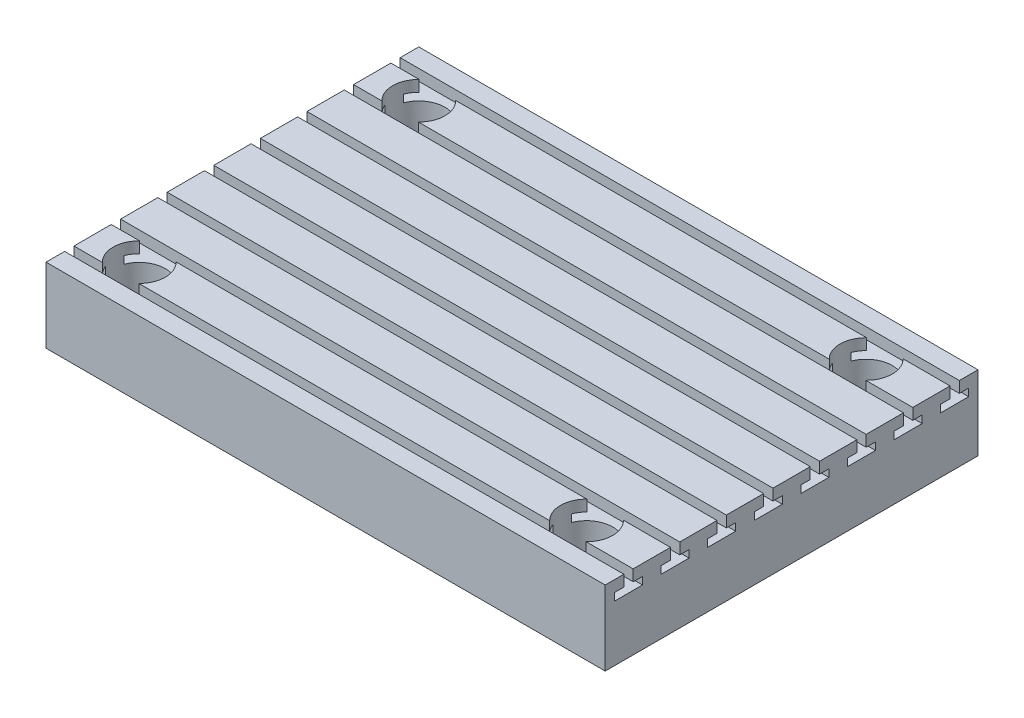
ISO-10303-21;
HEADER;
FILE_DESCRIPTION(('STEP AP214'),'2;1');
FILE_NAME('part.step','',(''),(''),'','','');
FILE_SCHEMA(('AUTOMOTIVE_DESIGN { 1 0 10303 214 1 1 1 1 }'));
ENDSEC;
DATA;
#1=APPLICATION_CONTEXT('core data for automotive mechanical design processes');
#2=APPLICATION_PROTOCOL_DEFINITION('international standard','automotive_design',2000,#1);
#3=PRODUCT_CONTEXT('',#1,'mechanical');
#4=PRODUCT('Part','Part','',(#3));
#5=PRODUCT_RELATED_PRODUCT_CATEGORY('part','',(#4));
#6=PRODUCT_DEFINITION_FORMATION('','',#4);
#7=PRODUCT_DEFINITION_CONTEXT('part definition',#1,'design');
#8=PRODUCT_DEFINITION('design','',#6,#7);
#9=PRODUCT_DEFINITION_SHAPE('','',#8);
#10=(LENGTH_UNIT() NAMED_UNIT(*) SI_UNIT(.MILLI.,.METRE.));
#11=(NAMED_UNIT(*) PLANE_ANGLE_UNIT() SI_UNIT($,.RADIAN.));
#12=(NAMED_UNIT(*) SI_UNIT($,.STERADIAN.) SOLID_ANGLE_UNIT());
#13=UNCERTAINTY_MEASURE_WITH_UNIT(LENGTH_MEASURE(1.E-05),#10,'distance_accuracy_value','');
#14=(GEOMETRIC_REPRESENTATION_CONTEXT(3) GLOBAL_UNCERTAINTY_ASSIGNED_CONTEXT((#13)) GLOBAL_UNIT_ASSIGNED_CONTEXT((#10,
#11,#12)) REPRESENTATION_CONTEXT('',''));
#15=CARTESIAN_POINT('',(0.,0.,0.));
#16=DIRECTION('',(0.,0.,1.));
#17=DIRECTION('',(1.,0.,0.));
#18=AXIS2_PLACEMENT_3D('',#15,#16,#17);
#19=CARTESIAN_POINT('',(-75.,20.,50.));
#20=DIRECTION('',(0.,1.,0.));
#21=DIRECTION('',(0.,0.,1.));
#22=AXIS2_PLACEMENT_3D('',#19,#20,#21);
#23=PLANE('',#22);
#24=DIRECTION('',(1.,0.,0.));
#25=VECTOR('',#24,1.);
#26=CARTESIAN_POINT('',(-75.,20.,-45.));
#27=LINE('',#26,#25);
#28=CARTESIAN_POINT('',(-75.,20.,-45.));
#29=VERTEX_POINT('',#28);
#30=CARTESIAN_POINT('',(75.,20.,-45.));
#31=VERTEX_POINT('',#30);
#32=EDGE_CURVE('E851',#29,#31,#27,.T.);
#33=ORIENTED_EDGE('',*,*,#32,.T.);
#34=DIRECTION('',(0.,0.,-1.));
#35=VECTOR('',#34,1.);
#36=CARTESIAN_POINT('',(75.,20.,-50.));
#37=LINE('',#36,#35);
#38=CARTESIAN_POINT('',(75.,20.,-50.));
#39=VERTEX_POINT('',#38);
#40=EDGE_CURVE('E689',#31,#39,#37,.T.);
#41=ORIENTED_EDGE('',*,*,#40,.T.);
#42=DIRECTION('',(-1.,0.,0.));
#43=VECTOR('',#42,1.);
#44=CARTESIAN_POINT('',(-75.,20.,-50.));
#45=LINE('',#44,#43);
#46=CARTESIAN_POINT('',(-75.,20.,-50.));
#47=VERTEX_POINT('',#46);
#48=EDGE_CURVE('E693',#39,#47,#45,.T.);
#49=ORIENTED_EDGE('',*,*,#48,.T.);
#50=DIRECTION('',(0.,0.,1.));
#51=VECTOR('',#50,1.);
#52=CARTESIAN_POINT('',(-75.,20.,-50.));
#53=LINE('',#52,#51);
#54=EDGE_CURVE('E677',#47,#29,#53,.T.);
#55=ORIENTED_EDGE('',*,*,#54,.T.);
#56=EDGE_LOOP('',(#33,#41,#49,#55));
#57=FACE_BOUND('',#56,.T.);
#58=ADVANCED_FACE('F31',(#57),#23,.T.);
#59=DIRECTION('',(1.,0.,0.));
#60=VECTOR('',#59,1.);
#61=CARTESIAN_POINT('',(-75.,20.,-42.5));
#62=LINE('',#61,#60);
#63=CARTESIAN_POINT('',(-75.,20.,-42.5));
#64=VERTEX_POINT('',#63);
#65=CARTESIAN_POINT('',(-67.3989794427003,20.,-42.5));
#66=VERTEX_POINT('',#65);
#67=EDGE_CURVE('E650',#64,#66,#62,.T.);
#68=ORIENTED_EDGE('',*,*,#67,.F.);
#69=CARTESIAN_POINT('',(-75.,20.,-32.5));
#70=VERTEX_POINT('',#69);
#71=EDGE_CURVE('E665',#64,#70,#53,.T.);
#72=ORIENTED_EDGE('',*,*,#71,.T.);
#73=DIRECTION('',(1.,0.,0.));
#74=VECTOR('',#73,1.);
#75=CARTESIAN_POINT('',(-75.,20.,-32.5));
#76=LINE('',#75,#74);
#77=CARTESIAN_POINT('',(-67.3989794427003,20.,-32.5));
#78=VERTEX_POINT('',#77);
#79=EDGE_CURVE('E1861',#70,#78,#76,.T.);
#80=ORIENTED_EDGE('',*,*,#79,.T.);
#81=CARTESIAN_POINT('',(-62.5,20.,-37.5));
#82=DIRECTION('',(0.,1.,0.));
#83=DIRECTION('',(0.,0.,1.));
#84=AXIS2_PLACEMENT_3D('',#81,#82,#83);
#85=CIRCLE('',#84,6.99999997);
#86=EDGE_CURVE('E667',#66,#78,#85,.T.);
#87=ORIENTED_EDGE('',*,*,#86,.F.);
#88=EDGE_LOOP('',(#68,#72,#80,#87));
#89=FACE_BOUND('',#88,.T.);
#90=ADVANCED_FACE('F663',(#89),#23,.T.);
#91=CARTESIAN_POINT('',(-57.6010205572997,20.,-42.5));
#92=VERTEX_POINT('',#91);
#93=CARTESIAN_POINT('',(52.6010205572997,20.,-42.5));
#94=VERTEX_POINT('',#93);
#95=EDGE_CURVE('E46',#92,#94,#62,.T.);
#96=ORIENTED_EDGE('',*,*,#95,.F.);
#97=CARTESIAN_POINT('',(-57.6010205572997,20.,-32.5));
#98=VERTEX_POINT('',#97);
#99=EDGE_CURVE('E720',#98,#92,#85,.T.);
#100=ORIENTED_EDGE('',*,*,#99,.F.);
#101=CARTESIAN_POINT('',(52.6010205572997,20.,-32.5));
#102=VERTEX_POINT('',#101);
#103=EDGE_CURVE('E1885',#98,#102,#76,.T.);
#104=ORIENTED_EDGE('',*,*,#103,.T.);
#105=CARTESIAN_POINT('',(57.5,20.,-37.5));
#106=DIRECTION('',(0.,1.,0.));
#107=DIRECTION('',(0.,0.,1.));
#108=AXIS2_PLACEMENT_3D('',#105,#106,#107);
#109=CIRCLE('',#108,6.99999997);
#110=EDGE_CURVE('E726',#94,#102,#109,.T.);
#111=ORIENTED_EDGE('',*,*,#110,.F.);
#112=EDGE_LOOP('',(#96,#100,#104,#111));
#113=FACE_BOUND('',#112,.T.);
#114=ADVANCED_FACE('F1382',(#113),#23,.T.);
#115=CARTESIAN_POINT('',(62.3989794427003,20.,-42.5));
#116=VERTEX_POINT('',#115);
#117=CARTESIAN_POINT('',(75.,20.,-42.5));
#118=VERTEX_POINT('',#117);
#119=EDGE_CURVE('E670',#116,#118,#62,.T.);
#120=ORIENTED_EDGE('',*,*,#119,.F.);
#121=CARTESIAN_POINT('',(62.3989794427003,20.,-32.5));
#122=VERTEX_POINT('',#121);
#123=EDGE_CURVE('E727',#122,#116,#109,.T.);
#124=ORIENTED_EDGE('',*,*,#123,.F.);
#125=CARTESIAN_POINT('',(75.,20.,-32.5));
#126=VERTEX_POINT('',#125);
#127=EDGE_CURVE('E1357',#122,#126,#76,.T.);
#128=ORIENTED_EDGE('',*,*,#127,.T.);
#129=EDGE_CURVE('E1346',#126,#118,#37,.T.);
#130=ORIENTED_EDGE('',*,*,#129,.T.);
#131=EDGE_LOOP('',(#120,#124,#128,#130));
#132=FACE_BOUND('',#131,.T.);
#133=ADVANCED_FACE('F1355',(#132),#23,.T.);
#134=DIRECTION('',(1.,0.,0.));
#135=VECTOR('',#134,1.);
#136=CARTESIAN_POINT('',(-75.,20.,-30.));
#137=LINE('',#136,#135);
#138=CARTESIAN_POINT('',(-75.,20.,-30.));
#139=VERTEX_POINT('',#138);
#140=CARTESIAN_POINT('',(75.,20.,-30.));
#141=VERTEX_POINT('',#140);
#142=EDGE_CURVE('E1862',#139,#141,#137,.T.);
#143=ORIENTED_EDGE('',*,*,#142,.F.);
#144=CARTESIAN_POINT('',(-75.,20.,-20.));
#145=VERTEX_POINT('',#144);
#146=EDGE_CURVE('E678',#139,#145,#53,.T.);
#147=ORIENTED_EDGE('',*,*,#146,.T.);
#148=DIRECTION('',(1.,0.,0.));
#149=VECTOR('',#148,1.);
#150=CARTESIAN_POINT('',(-75.,20.,-20.));
#151=LINE('',#150,#149);
#152=CARTESIAN_POINT('',(75.,20.,-20.));
#153=VERTEX_POINT('',#152);
#154=EDGE_CURVE('E983',#145,#153,#151,.T.);
#155=ORIENTED_EDGE('',*,*,#154,.T.);
#156=EDGE_CURVE('E1344',#153,#141,#37,.T.);
#157=ORIENTED_EDGE('',*,*,#156,.T.);
#158=EDGE_LOOP('',(#143,#147,#155,#157));
#159=FACE_BOUND('',#158,.T.);
#160=ADVANCED_FACE('F1606',(#159),#23,.T.);
#161=DIRECTION('',(1.,0.,0.));
#162=VECTOR('',#161,1.);
#163=CARTESIAN_POINT('',(-75.,20.,-17.5));
#164=LINE('',#163,#162);
#165=CARTESIAN_POINT('',(-75.,20.,-17.5));
#166=VERTEX_POINT('',#165);
#167=CARTESIAN_POINT('',(75.,20.,-17.5));
#168=VERTEX_POINT('',#167);
#169=EDGE_CURVE('E955',#166,#168,#164,.T.);
#170=ORIENTED_EDGE('',*,*,#169,.F.);
#171=CARTESIAN_POINT('',(-75.,20.,-7.50000000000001));
#172=VERTEX_POINT('',#171);
#173=EDGE_CURVE('E683',#166,#172,#53,.T.);
#174=ORIENTED_EDGE('',*,*,#173,.T.);
#175=DIRECTION('',(1.,0.,0.));
#176=VECTOR('',#175,1.);
#177=CARTESIAN_POINT('',(-75.,20.,-7.50000000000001));
#178=LINE('',#177,#176);
#179=CARTESIAN_POINT('',(75.,20.,-7.50000000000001));
#180=VERTEX_POINT('',#179);
#181=EDGE_CURVE('E953',#172,#180,#178,.T.);
#182=ORIENTED_EDGE('',*,*,#181,.T.);
#183=EDGE_CURVE('E1342',#180,#168,#37,.T.);
#184=ORIENTED_EDGE('',*,*,#183,.T.);
#185=EDGE_LOOP('',(#170,#174,#182,#184));
#186=FACE_BOUND('',#185,.T.);
#187=ADVANCED_FACE('F951',(#186),#23,.T.);
#188=DIRECTION('',(1.,0.,0.));
#189=VECTOR('',#188,1.);
#190=CARTESIAN_POINT('',(-75.,20.,-5.00000000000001));
#191=LINE('',#190,#189);
#192=CARTESIAN_POINT('',(-75.,20.,-5.00000000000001));
#193=VERTEX_POINT('',#192);
#194=CARTESIAN_POINT('',(75.,20.,-5.00000000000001));
#195=VERTEX_POINT('',#194);
#196=EDGE_CURVE('E971',#193,#195,#191,.T.);
#197=ORIENTED_EDGE('',*,*,#196,.F.);
#198=CARTESIAN_POINT('',(-75.,20.,4.99999999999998));
#199=VERTEX_POINT('',#198);
#200=EDGE_CURVE('E935',#193,#199,#53,.T.);
#201=ORIENTED_EDGE('',*,*,#200,.T.);
#202=DIRECTION('',(1.,0.,0.));
#203=VECTOR('',#202,1.);
#204=CARTESIAN_POINT('',(-75.,20.,4.99999999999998));
#205=LINE('',#204,#203);
#206=CARTESIAN_POINT('',(75.,20.,4.99999999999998));
#207=VERTEX_POINT('',#206);
#208=EDGE_CURVE('E1051',#199,#207,#205,.T.);
#209=ORIENTED_EDGE('',*,*,#208,.T.);
#210=EDGE_CURVE('E1339',#207,#195,#37,.T.);
#211=ORIENTED_EDGE('',*,*,#210,.T.);
#212=EDGE_LOOP('',(#197,#201,#209,#211));
#213=FACE_BOUND('',#212,.T.);
#214=ADVANCED_FACE('F1621',(#213),#23,.T.);
#215=DIRECTION('',(1.,0.,0.));
#216=VECTOR('',#215,1.);
#217=CARTESIAN_POINT('',(-75.,20.,7.49999999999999));
#218=LINE('',#217,#216);
#219=CARTESIAN_POINT('',(-75.,20.,7.49999999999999));
#220=VERTEX_POINT('',#219);
#221=CARTESIAN_POINT('',(75.,20.,7.49999999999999));
#222=VERTEX_POINT('',#221);
#223=EDGE_CURVE('E1032',#220,#222,#218,.T.);
#224=ORIENTED_EDGE('',*,*,#223,.F.);
#225=CARTESIAN_POINT('',(-75.,20.,17.5));
#226=VERTEX_POINT('',#225);
#227=EDGE_CURVE('E929',#220,#226,#53,.T.);
#228=ORIENTED_EDGE('',*,*,#227,.T.);
#229=DIRECTION('',(1.,0.,0.));
#230=VECTOR('',#229,1.);
#231=CARTESIAN_POINT('',(-75.,20.,17.5));
#232=LINE('',#231,#230);
#233=CARTESIAN_POINT('',(75.,20.,17.5));
#234=VERTEX_POINT('',#233);
#235=EDGE_CURVE('E1108',#226,#234,#232,.T.);
#236=ORIENTED_EDGE('',*,*,#235,.T.);
#237=EDGE_CURVE('E1336',#234,#222,#37,.T.);
#238=ORIENTED_EDGE('',*,*,#237,.T.);
#239=EDGE_LOOP('',(#224,#228,#236,#238));
#240=FACE_BOUND('',#239,.T.);
#241=ADVANCED_FACE('F1406',(#240),#23,.T.);
#242=DIRECTION('',(1.,0.,0.));
#243=VECTOR('',#242,1.);
#244=CARTESIAN_POINT('',(-75.,20.,20.));
#245=LINE('',#244,#243);
#246=CARTESIAN_POINT('',(-75.,20.,20.));
#247=VERTEX_POINT('',#246);
#248=CARTESIAN_POINT('',(75.,20.,20.));
#249=VERTEX_POINT('',#248);
#250=EDGE_CURVE('E1089',#247,#249,#245,.T.);
#251=ORIENTED_EDGE('',*,*,#250,.F.);
#252=CARTESIAN_POINT('',(-75.,20.,30.));
#253=VERTEX_POINT('',#252);
#254=EDGE_CURVE('E923',#247,#253,#53,.T.);
#255=ORIENTED_EDGE('',*,*,#254,.T.);
#256=DIRECTION('',(1.,0.,0.));
#257=VECTOR('',#256,1.);
#258=CARTESIAN_POINT('',(-75.,20.,30.));
#259=LINE('',#258,#257);
#260=CARTESIAN_POINT('',(75.,20.,30.));
#261=VERTEX_POINT('',#260);
#262=EDGE_CURVE('E1165',#253,#261,#259,.T.);
#263=ORIENTED_EDGE('',*,*,#262,.T.);
#264=EDGE_CURVE('E1334',#261,#249,#37,.T.);
#265=ORIENTED_EDGE('',*,*,#264,.T.);
#266=EDGE_LOOP('',(#251,#255,#263,#265));
#267=FACE_BOUND('',#266,.T.);
#268=ADVANCED_FACE('F1402',(#267),#23,.T.);
#269=DIRECTION('',(1.,0.,0.));
#270=VECTOR('',#269,1.);
#271=CARTESIAN_POINT('',(-75.,20.,32.5));
#272=LINE('',#271,#270);
#273=CARTESIAN_POINT('',(-75.,20.,32.5));
#274=VERTEX_POINT('',#273);
#275=CARTESIAN_POINT('',(-67.3989794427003,20.,32.5));
#276=VERTEX_POINT('',#275);
#277=EDGE_CURVE('E1189',#274,#276,#272,.T.);
#278=ORIENTED_EDGE('',*,*,#277,.F.);
#279=CARTESIAN_POINT('',(-75.,20.,42.5));
#280=VERTEX_POINT('',#279);
#281=EDGE_CURVE('E922',#274,#280,#53,.T.);
#282=ORIENTED_EDGE('',*,*,#281,.T.);
#283=DIRECTION('',(1.,0.,0.));
#284=VECTOR('',#283,1.);
#285=CARTESIAN_POINT('',(-75.,20.,42.5));
#286=LINE('',#285,#284);
#287=CARTESIAN_POINT('',(-67.3989794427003,20.,42.5));
#288=VERTEX_POINT('',#287);
#289=EDGE_CURVE('E1249',#280,#288,#286,.T.);
#290=ORIENTED_EDGE('',*,*,#289,.T.);
#291=CARTESIAN_POINT('',(-62.5,20.,37.5));
#292=DIRECTION('',(0.,1.,0.));
#293=DIRECTION('',(0.,0.,1.));
#294=AXIS2_PLACEMENT_3D('',#291,#292,#293);
#295=CIRCLE('',#294,6.99999997);
#296=EDGE_CURVE('E1302',#276,#288,#295,.T.);
#297=ORIENTED_EDGE('',*,*,#296,.F.);
#298=EDGE_LOOP('',(#278,#282,#290,#297));
#299=FACE_BOUND('',#298,.T.);
#300=ADVANCED_FACE('F1398',(#299),#23,.T.);
#301=CARTESIAN_POINT('',(-57.6010205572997,20.,32.5));
#302=VERTEX_POINT('',#301);
#303=CARTESIAN_POINT('',(52.6010205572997,20.,32.5));
#304=VERTEX_POINT('',#303);
#305=EDGE_CURVE('E1191',#302,#304,#272,.T.);
#306=ORIENTED_EDGE('',*,*,#305,.F.);
#307=CARTESIAN_POINT('',(-57.6010205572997,20.,42.5));
#308=VERTEX_POINT('',#307);
#309=EDGE_CURVE('E686',#308,#302,#295,.T.);
#310=ORIENTED_EDGE('',*,*,#309,.F.);
#311=CARTESIAN_POINT('',(52.6010205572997,20.,42.5));
#312=VERTEX_POINT('',#311);
#313=EDGE_CURVE('E1252',#308,#312,#286,.T.);
#314=ORIENTED_EDGE('',*,*,#313,.T.);
#315=CARTESIAN_POINT('',(57.5,20.,37.5));
#316=DIRECTION('',(0.,1.,0.));
#317=DIRECTION('',(0.,0.,1.));
#318=AXIS2_PLACEMENT_3D('',#315,#316,#317);
#319=CIRCLE('',#318,6.99999997);
#320=EDGE_CURVE('E1297',#304,#312,#319,.T.);
#321=ORIENTED_EDGE('',*,*,#320,.F.);
#322=EDGE_LOOP('',(#306,#310,#314,#321));
#323=FACE_BOUND('',#322,.T.);
#324=ADVANCED_FACE('F1315',(#323),#23,.T.);
#325=CARTESIAN_POINT('',(62.3989794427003,20.,32.5));
#326=VERTEX_POINT('',#325);
#327=CARTESIAN_POINT('',(75.,20.,32.5));
#328=VERTEX_POINT('',#327);
#329=EDGE_CURVE('E1146',#326,#328,#272,.T.);
#330=ORIENTED_EDGE('',*,*,#329,.F.);
#331=CARTESIAN_POINT('',(62.3989794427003,20.,42.5));
#332=VERTEX_POINT('',#331);
#333=EDGE_CURVE('E1298',#332,#326,#319,.T.);
#334=ORIENTED_EDGE('',*,*,#333,.F.);
#335=CARTESIAN_POINT('',(75.,20.,42.5));
#336=VERTEX_POINT('',#335);
#337=EDGE_CURVE('E1253',#332,#336,#286,.T.);
#338=ORIENTED_EDGE('',*,*,#337,.T.);
#339=EDGE_CURVE('E694',#336,#328,#37,.T.);
#340=ORIENTED_EDGE('',*,*,#339,.T.);
#341=EDGE_LOOP('',(#330,#334,#338,#340));
#342=FACE_BOUND('',#341,.T.);
#343=ADVANCED_FACE('F1333',(#342),#23,.T.);
#344=CARTESIAN_POINT('',(-75.,20.,-50.));
#345=DIRECTION('',(1.,0.,0.));
#346=DIRECTION('',(0.,0.,-1.));
#347=AXIS2_PLACEMENT_3D('',#344,#345,#346);
#348=PLANE('',#347);
#349=DIRECTION('',(0.,0.,1.));
#350=VECTOR('',#349,1.);
#351=CARTESIAN_POINT('',(-75.,17.,-47.5));
#352=LINE('',#351,#350);
#353=CARTESIAN_POINT('',(-75.,17.,-47.5));
#354=VERTEX_POINT('',#353);
#355=CARTESIAN_POINT('',(-75.,17.,-45.));
#356=VERTEX_POINT('',#355);
#357=EDGE_CURVE('E871',#354,#356,#352,.T.);
#358=ORIENTED_EDGE('',*,*,#357,.T.);
#359=DIRECTION('',(0.,1.,0.));
#360=VECTOR('',#359,1.);
#361=CARTESIAN_POINT('',(-75.,17.,-45.));
#362=LINE('',#361,#360);
#363=EDGE_CURVE('E868',#356,#29,#362,.T.);
#364=ORIENTED_EDGE('',*,*,#363,.T.);
#365=ORIENTED_EDGE('',*,*,#54,.F.);
#366=DIRECTION('',(0.,-1.,0.));
#367=VECTOR('',#366,1.);
#368=CARTESIAN_POINT('',(-75.,20.,-50.));
#369=LINE('',#368,#367);
#370=CARTESIAN_POINT('',(-75.,0.,-50.));
#371=VERTEX_POINT('',#370);
#372=EDGE_CURVE('E696',#47,#371,#369,.T.);
#373=ORIENTED_EDGE('',*,*,#372,.T.);
#374=DIRECTION('',(0.,0.,1.));
#375=VECTOR('',#374,1.);
#376=CARTESIAN_POINT('',(-75.,0.,-50.));
#377=LINE('',#376,#375);
#378=CARTESIAN_POINT('',(-75.,0.,50.));
#379=VERTEX_POINT('',#378);
#380=EDGE_CURVE('E697',#371,#379,#377,.T.);
#381=ORIENTED_EDGE('',*,*,#380,.T.);
#382=DIRECTION('',(0.,-1.,0.));
#383=VECTOR('',#382,1.);
#384=CARTESIAN_POINT('',(-75.,20.,50.));
#385=LINE('',#384,#383);
#386=CARTESIAN_POINT('',(-75.,20.,50.));
#387=VERTEX_POINT('',#386);
#388=EDGE_CURVE('E714',#387,#379,#385,.T.);
#389=ORIENTED_EDGE('',*,*,#388,.F.);
#390=CARTESIAN_POINT('',(-75.,20.,45.));
#391=VERTEX_POINT('',#390);
#392=EDGE_CURVE('E682',#391,#387,#53,.T.);
#393=ORIENTED_EDGE('',*,*,#392,.F.);
#394=DIRECTION('',(0.,-1.,0.));
#395=VECTOR('',#394,1.);
#396=CARTESIAN_POINT('',(-75.,20.,45.));
#397=LINE('',#396,#395);
#398=CARTESIAN_POINT('',(-75.,17.,45.));
#399=VERTEX_POINT('',#398);
#400=EDGE_CURVE('E919',#391,#399,#397,.T.);
#401=ORIENTED_EDGE('',*,*,#400,.T.);
#402=DIRECTION('',(0.,0.,1.));
#403=VECTOR('',#402,1.);
#404=CARTESIAN_POINT('',(-75.,17.,45.));
#405=LINE('',#404,#403);
#406=CARTESIAN_POINT('',(-75.,17.,47.5));
#407=VERTEX_POINT('',#406);
#408=EDGE_CURVE('E1212',#399,#407,#405,.T.);
#409=ORIENTED_EDGE('',*,*,#408,.T.);
#410=DIRECTION('',(0.,-1.,0.));
#411=VECTOR('',#410,1.);
#412=CARTESIAN_POINT('',(-75.,17.,47.5));
#413=LINE('',#412,#411);
#414=CARTESIAN_POINT('',(-75.,15.,47.5));
#415=VERTEX_POINT('',#414);
#416=EDGE_CURVE('E1215',#407,#415,#413,.T.);
#417=ORIENTED_EDGE('',*,*,#416,.T.);
#418=DIRECTION('',(0.,0.,-1.));
#419=VECTOR('',#418,1.);
#420=CARTESIAN_POINT('',(-75.,15.,47.5));
#421=LINE('',#420,#419);
#422=CARTESIAN_POINT('',(-75.,15.,40.));
#423=VERTEX_POINT('',#422);
#424=EDGE_CURVE('E1218',#415,#423,#421,.T.);
#425=ORIENTED_EDGE('',*,*,#424,.T.);
#426=DIRECTION('',(0.,1.,0.));
#427=VECTOR('',#426,1.);
#428=CARTESIAN_POINT('',(-75.,15.,40.));
#429=LINE('',#428,#427);
#430=CARTESIAN_POINT('',(-75.,17.,40.));
#431=VERTEX_POINT('',#430);
#432=EDGE_CURVE('E1221',#423,#431,#429,.T.);
#433=ORIENTED_EDGE('',*,*,#432,.T.);
#434=DIRECTION('',(0.,0.,1.));
#435=VECTOR('',#434,1.);
#436=CARTESIAN_POINT('',(-75.,17.,40.));
#437=LINE('',#436,#435);
#438=CARTESIAN_POINT('',(-75.,17.,42.5));
#439=VERTEX_POINT('',#438);
#440=EDGE_CURVE('E1224',#431,#439,#437,.T.);
#441=ORIENTED_EDGE('',*,*,#440,.T.);
#442=DIRECTION('',(0.,1.,0.));
#443=VECTOR('',#442,1.);
#444=CARTESIAN_POINT('',(-75.,17.,42.5));
#445=LINE('',#444,#443);
#446=EDGE_CURVE('E1227',#439,#280,#445,.T.);
#447=ORIENTED_EDGE('',*,*,#446,.T.);
#448=ORIENTED_EDGE('',*,*,#281,.F.);
#449=DIRECTION('',(0.,-1.,0.));
#450=VECTOR('',#449,1.);
#451=CARTESIAN_POINT('',(-75.,20.,32.5));
#452=LINE('',#451,#450);
#453=CARTESIAN_POINT('',(-75.,17.,32.5));
#454=VERTEX_POINT('',#453);
#455=EDGE_CURVE('E1124',#274,#454,#452,.T.);
#456=ORIENTED_EDGE('',*,*,#455,.T.);
#457=DIRECTION('',(0.,0.,1.));
#458=VECTOR('',#457,1.);
#459=CARTESIAN_POINT('',(-75.,17.,32.5));
#460=LINE('',#459,#458);
#461=CARTESIAN_POINT('',(-75.,17.,35.));
#462=VERTEX_POINT('',#461);
#463=EDGE_CURVE('E1127',#454,#462,#460,.T.);
#464=ORIENTED_EDGE('',*,*,#463,.T.);
#465=DIRECTION('',(0.,-1.,0.));
#466=VECTOR('',#465,1.);
#467=CARTESIAN_POINT('',(-75.,17.,35.));
#468=LINE('',#467,#466);
#469=CARTESIAN_POINT('',(-75.,15.,35.));
#470=VERTEX_POINT('',#469);
#471=EDGE_CURVE('E1131',#462,#470,#468,.T.);
#472=ORIENTED_EDGE('',*,*,#471,.T.);
#473=DIRECTION('',(0.,0.,-1.));
#474=VECTOR('',#473,1.);
#475=CARTESIAN_POINT('',(-75.,15.,35.));
#476=LINE('',#475,#474);
#477=CARTESIAN_POINT('',(-75.,15.,27.5));
#478=VERTEX_POINT('',#477);
#479=EDGE_CURVE('E1134',#470,#478,#476,.T.);
#480=ORIENTED_EDGE('',*,*,#479,.T.);
#481=DIRECTION('',(0.,1.,0.));
#482=VECTOR('',#481,1.);
#483=CARTESIAN_POINT('',(-75.,15.,27.5));
#484=LINE('',#483,#482);
#485=CARTESIAN_POINT('',(-75.,17.,27.5));
#486=VERTEX_POINT('',#485);
#487=EDGE_CURVE('E1137',#478,#486,#484,.T.);
#488=ORIENTED_EDGE('',*,*,#487,.T.);
#489=DIRECTION('',(0.,0.,1.));
#490=VECTOR('',#489,1.);
#491=CARTESIAN_POINT('',(-75.,17.,27.5));
#492=LINE('',#491,#490);
#493=CARTESIAN_POINT('',(-75.,17.,30.));
#494=VERTEX_POINT('',#493);
#495=EDGE_CURVE('E1140',#486,#494,#492,.T.);
#496=ORIENTED_EDGE('',*,*,#495,.T.);
#497=DIRECTION('',(0.,1.,0.));
#498=VECTOR('',#497,1.);
#499=CARTESIAN_POINT('',(-75.,17.,30.));
#500=LINE('',#499,#498);
#501=EDGE_CURVE('E1143',#494,#253,#500,.T.);
#502=ORIENTED_EDGE('',*,*,#501,.T.);
#503=ORIENTED_EDGE('',*,*,#254,.F.);
#504=DIRECTION('',(0.,-1.,0.));
#505=VECTOR('',#504,1.);
#506=CARTESIAN_POINT('',(-75.,20.,20.));
#507=LINE('',#506,#505);
#508=CARTESIAN_POINT('',(-75.,17.,20.));
#509=VERTEX_POINT('',#508);
#510=EDGE_CURVE('E1067',#247,#509,#507,.T.);
#511=ORIENTED_EDGE('',*,*,#510,.T.);
#512=DIRECTION('',(0.,0.,1.));
#513=VECTOR('',#512,1.);
#514=CARTESIAN_POINT('',(-75.,17.,20.));
#515=LINE('',#514,#513);
#516=CARTESIAN_POINT('',(-75.,17.,22.5));
#517=VERTEX_POINT('',#516);
#518=EDGE_CURVE('E1070',#509,#517,#515,.T.);
#519=ORIENTED_EDGE('',*,*,#518,.T.);
#520=DIRECTION('',(0.,-1.,0.));
#521=VECTOR('',#520,1.);
#522=CARTESIAN_POINT('',(-75.,17.,22.5));
#523=LINE('',#522,#521);
#524=CARTESIAN_POINT('',(-75.,15.,22.5));
#525=VERTEX_POINT('',#524);
#526=EDGE_CURVE('E1074',#517,#525,#523,.T.);
#527=ORIENTED_EDGE('',*,*,#526,.T.);
#528=DIRECTION('',(0.,0.,-1.));
#529=VECTOR('',#528,1.);
#530=CARTESIAN_POINT('',(-75.,15.,22.5));
#531=LINE('',#530,#529);
#532=CARTESIAN_POINT('',(-75.,15.,15.));
#533=VERTEX_POINT('',#532);
#534=EDGE_CURVE('E1077',#525,#533,#531,.T.);
#535=ORIENTED_EDGE('',*,*,#534,.T.);
#536=DIRECTION('',(0.,1.,0.));
#537=VECTOR('',#536,1.);
#538=CARTESIAN_POINT('',(-75.,15.,15.));
#539=LINE('',#538,#537);
#540=CARTESIAN_POINT('',(-75.,17.,15.));
#541=VERTEX_POINT('',#540);
#542=EDGE_CURVE('E1080',#533,#541,#539,.T.);
#543=ORIENTED_EDGE('',*,*,#542,.T.);
#544=DIRECTION('',(0.,0.,1.));
#545=VECTOR('',#544,1.);
#546=CARTESIAN_POINT('',(-75.,17.,15.));
#547=LINE('',#546,#545);
#548=CARTESIAN_POINT('',(-75.,17.,17.5));
#549=VERTEX_POINT('',#548);
#550=EDGE_CURVE('E1083',#541,#549,#547,.T.);
#551=ORIENTED_EDGE('',*,*,#550,.T.);
#552=DIRECTION('',(0.,1.,0.));
#553=VECTOR('',#552,1.);
#554=CARTESIAN_POINT('',(-75.,17.,17.5));
#555=LINE('',#554,#553);
#556=EDGE_CURVE('E1086',#549,#226,#555,.T.);
#557=ORIENTED_EDGE('',*,*,#556,.T.);
#558=ORIENTED_EDGE('',*,*,#227,.F.);
#559=DIRECTION('',(0.,-1.,0.));
#560=VECTOR('',#559,1.);
#561=CARTESIAN_POINT('',(-75.,20.,7.49999999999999));
#562=LINE('',#561,#560);
#563=CARTESIAN_POINT('',(-75.,17.,7.49999999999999));
#564=VERTEX_POINT('',#563);
#565=EDGE_CURVE('E1010',#220,#564,#562,.T.);
#566=ORIENTED_EDGE('',*,*,#565,.T.);
#567=DIRECTION('',(0.,0.,1.));
#568=VECTOR('',#567,1.);
#569=CARTESIAN_POINT('',(-75.,17.,7.49999999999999));
#570=LINE('',#569,#568);
#571=CARTESIAN_POINT('',(-75.,17.,9.99999999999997));
#572=VERTEX_POINT('',#571);
#573=EDGE_CURVE('E1013',#564,#572,#570,.T.);
#574=ORIENTED_EDGE('',*,*,#573,.T.);
#575=DIRECTION('',(0.,-1.,0.));
#576=VECTOR('',#575,1.);
#577=CARTESIAN_POINT('',(-75.,17.,9.99999999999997));
#578=LINE('',#577,#576);
#579=CARTESIAN_POINT('',(-75.,15.,9.99999999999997));
#580=VERTEX_POINT('',#579);
#581=EDGE_CURVE('E1017',#572,#580,#578,.T.);
#582=ORIENTED_EDGE('',*,*,#581,.T.);
#583=DIRECTION('',(0.,0.,-1.));
#584=VECTOR('',#583,1.);
#585=CARTESIAN_POINT('',(-75.,15.,9.99999999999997));
#586=LINE('',#585,#584);
#587=CARTESIAN_POINT('',(-75.,15.,2.5));
#588=VERTEX_POINT('',#587);
#589=EDGE_CURVE('E1020',#580,#588,#586,.T.);
#590=ORIENTED_EDGE('',*,*,#589,.T.);
#591=DIRECTION('',(0.,1.,0.));
#592=VECTOR('',#591,1.);
#593=CARTESIAN_POINT('',(-75.,15.,2.5));
#594=LINE('',#593,#592);
#595=CARTESIAN_POINT('',(-75.,17.,2.5));
#596=VERTEX_POINT('',#595);
#597=EDGE_CURVE('E1023',#588,#596,#594,.T.);
#598=ORIENTED_EDGE('',*,*,#597,.T.);
#599=DIRECTION('',(0.,0.,1.));
#600=VECTOR('',#599,1.);
#601=CARTESIAN_POINT('',(-75.,17.,2.5));
#602=LINE('',#601,#600);
#603=CARTESIAN_POINT('',(-75.,17.,4.99999999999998));
#604=VERTEX_POINT('',#603);
#605=EDGE_CURVE('E1026',#596,#604,#602,.T.);
#606=ORIENTED_EDGE('',*,*,#605,.T.);
#607=DIRECTION('',(0.,1.,0.));
#608=VECTOR('',#607,1.);
#609=CARTESIAN_POINT('',(-75.,17.,4.99999999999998));
#610=LINE('',#609,#608);
#611=EDGE_CURVE('E1029',#604,#199,#610,.T.);
#612=ORIENTED_EDGE('',*,*,#611,.T.);
#613=ORIENTED_EDGE('',*,*,#200,.F.);
#614=DIRECTION('',(0.,-1.,0.));
#615=VECTOR('',#614,1.);
#616=CARTESIAN_POINT('',(-75.,20.,-5.00000000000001));
#617=LINE('',#616,#615);
#618=CARTESIAN_POINT('',(-75.,17.,-5.00000000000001));
#619=VERTEX_POINT('',#618);
#620=EDGE_CURVE('E998',#193,#619,#617,.T.);
#621=ORIENTED_EDGE('',*,*,#620,.T.);
#622=DIRECTION('',(0.,0.,1.));
#623=VECTOR('',#622,1.);
#624=CARTESIAN_POINT('',(-75.,17.,-5.00000000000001));
#625=LINE('',#624,#623);
#626=CARTESIAN_POINT('',(-75.,17.,-2.50000000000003));
#627=VERTEX_POINT('',#626);
#628=EDGE_CURVE('E1762',#619,#627,#625,.T.);
#629=ORIENTED_EDGE('',*,*,#628,.T.);
#630=DIRECTION('',(0.,-1.,0.));
#631=VECTOR('',#630,1.);
#632=CARTESIAN_POINT('',(-75.,17.,-2.50000000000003));
#633=LINE('',#632,#631);
#634=CARTESIAN_POINT('',(-75.,15.,-2.50000000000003));
#635=VERTEX_POINT('',#634);
#636=EDGE_CURVE('E1764',#627,#635,#633,.T.);
#637=ORIENTED_EDGE('',*,*,#636,.T.);
#638=DIRECTION('',(0.,0.,-1.));
#639=VECTOR('',#638,1.);
#640=CARTESIAN_POINT('',(-75.,15.,-2.50000000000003));
#641=LINE('',#640,#639);
#642=CARTESIAN_POINT('',(-75.,15.,-9.99999999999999));
#643=VERTEX_POINT('',#642);
#644=EDGE_CURVE('E1770',#635,#643,#641,.T.);
#645=ORIENTED_EDGE('',*,*,#644,.T.);
#646=DIRECTION('',(0.,1.,0.));
#647=VECTOR('',#646,1.);
#648=CARTESIAN_POINT('',(-75.,15.,-9.99999999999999));
#649=LINE('',#648,#647);
#650=CARTESIAN_POINT('',(-75.,17.,-9.99999999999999));
#651=VERTEX_POINT('',#650);
#652=EDGE_CURVE('E975',#643,#651,#649,.T.);
#653=ORIENTED_EDGE('',*,*,#652,.T.);
#654=DIRECTION('',(0.,0.,1.));
#655=VECTOR('',#654,1.);
#656=CARTESIAN_POINT('',(-75.,17.,-9.99999999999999));
#657=LINE('',#656,#655);
#658=CARTESIAN_POINT('',(-75.,17.,-7.50000000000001));
#659=VERTEX_POINT('',#658);
#660=EDGE_CURVE('E970',#651,#659,#657,.T.);
#661=ORIENTED_EDGE('',*,*,#660,.T.);
#662=DIRECTION('',(0.,1.,0.));
#663=VECTOR('',#662,1.);
#664=CARTESIAN_POINT('',(-75.,17.,-7.50000000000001));
#665=LINE('',#664,#663);
#666=EDGE_CURVE('E961',#659,#172,#665,.T.);
#667=ORIENTED_EDGE('',*,*,#666,.T.);
#668=ORIENTED_EDGE('',*,*,#173,.F.);
#669=DIRECTION('',(0.,-1.,0.));
#670=VECTOR('',#669,1.);
#671=CARTESIAN_POINT('',(-75.,20.,-17.5));
#672=LINE('',#671,#670);
#673=CARTESIAN_POINT('',(-75.,17.,-17.5));
#674=VERTEX_POINT('',#673);
#675=EDGE_CURVE('E1812',#166,#674,#672,.T.);
#676=ORIENTED_EDGE('',*,*,#675,.T.);
#677=DIRECTION('',(0.,0.,1.));
#678=VECTOR('',#677,1.);
#679=CARTESIAN_POINT('',(-75.,17.,-17.5));
#680=LINE('',#679,#678);
#681=CARTESIAN_POINT('',(-75.,17.,-15.));
#682=VERTEX_POINT('',#681);
#683=EDGE_CURVE('E1842',#674,#682,#680,.T.);
#684=ORIENTED_EDGE('',*,*,#683,.T.);
#685=DIRECTION('',(0.,-1.,0.));
#686=VECTOR('',#685,1.);
#687=CARTESIAN_POINT('',(-75.,17.,-15.));
#688=LINE('',#687,#686);
#689=CARTESIAN_POINT('',(-75.,15.,-15.));
#690=VERTEX_POINT('',#689);
#691=EDGE_CURVE('E1839',#682,#690,#688,.T.);
#692=ORIENTED_EDGE('',*,*,#691,.T.);
#693=DIRECTION('',(0.,0.,-1.));
#694=VECTOR('',#693,1.);
#695=CARTESIAN_POINT('',(-75.,15.,-15.));
#696=LINE('',#695,#694);
#697=CARTESIAN_POINT('',(-75.,15.,-22.5));
#698=VERTEX_POINT('',#697);
#699=EDGE_CURVE('E1834',#690,#698,#696,.T.);
#700=ORIENTED_EDGE('',*,*,#699,.T.);
#701=DIRECTION('',(0.,1.,0.));
#702=VECTOR('',#701,1.);
#703=CARTESIAN_POINT('',(-75.,15.,-22.5));
#704=LINE('',#703,#702);
#705=CARTESIAN_POINT('',(-75.,17.,-22.5));
#706=VERTEX_POINT('',#705);
#707=EDGE_CURVE('E1831',#698,#706,#704,.T.);
#708=ORIENTED_EDGE('',*,*,#707,.T.);
#709=DIRECTION('',(0.,0.,1.));
#710=VECTOR('',#709,1.);
#711=CARTESIAN_POINT('',(-75.,17.,-22.5));
#712=LINE('',#711,#710);
#713=CARTESIAN_POINT('',(-75.,17.,-20.));
#714=VERTEX_POINT('',#713);
#715=EDGE_CURVE('E1827',#706,#714,#712,.T.);
#716=ORIENTED_EDGE('',*,*,#715,.T.);
#717=DIRECTION('',(0.,1.,0.));
#718=VECTOR('',#717,1.);
#719=CARTESIAN_POINT('',(-75.,17.,-20.));
#720=LINE('',#719,#718);
#721=EDGE_CURVE('E1796',#714,#145,#720,.T.);
#722=ORIENTED_EDGE('',*,*,#721,.T.);
#723=ORIENTED_EDGE('',*,*,#146,.F.);
#724=DIRECTION('',(0.,-1.,0.));
#725=VECTOR('',#724,1.);
#726=CARTESIAN_POINT('',(-75.,20.,-30.));
#727=LINE('',#726,#725);
#728=CARTESIAN_POINT('',(-75.,17.,-30.));
#729=VERTEX_POINT('',#728);
#730=EDGE_CURVE('E1887',#139,#729,#727,.T.);
#731=ORIENTED_EDGE('',*,*,#730,.T.);
#732=DIRECTION('',(0.,0.,1.));
#733=VECTOR('',#732,1.);
#734=CARTESIAN_POINT('',(-75.,17.,-30.));
#735=LINE('',#734,#733);
#736=CARTESIAN_POINT('',(-75.,17.,-27.5));
#737=VERTEX_POINT('',#736);
#738=EDGE_CURVE('E1918',#729,#737,#735,.T.);
#739=ORIENTED_EDGE('',*,*,#738,.T.);
#740=DIRECTION('',(0.,-1.,0.));
#741=VECTOR('',#740,1.);
#742=CARTESIAN_POINT('',(-75.,17.,-27.5));
#743=LINE('',#742,#741);
#744=CARTESIAN_POINT('',(-75.,15.,-27.5));
#745=VERTEX_POINT('',#744);
#746=EDGE_CURVE('E1915',#737,#745,#743,.T.);
#747=ORIENTED_EDGE('',*,*,#746,.T.);
#748=DIRECTION('',(0.,0.,-1.));
#749=VECTOR('',#748,1.);
#750=CARTESIAN_POINT('',(-75.,15.,-27.5));
#751=LINE('',#750,#749);
#752=CARTESIAN_POINT('',(-75.,15.,-35.));
#753=VERTEX_POINT('',#752);
#754=EDGE_CURVE('E1912',#745,#753,#751,.T.);
#755=ORIENTED_EDGE('',*,*,#754,.T.);
#756=DIRECTION('',(0.,1.,0.));
#757=VECTOR('',#756,1.);
#758=CARTESIAN_POINT('',(-75.,15.,-35.));
#759=LINE('',#758,#757);
#760=CARTESIAN_POINT('',(-75.,17.,-35.));
#761=VERTEX_POINT('',#760);
#762=EDGE_CURVE('E1909',#753,#761,#759,.T.);
#763=ORIENTED_EDGE('',*,*,#762,.T.);
#764=DIRECTION('',(0.,0.,1.));
#765=VECTOR('',#764,1.);
#766=CARTESIAN_POINT('',(-75.,17.,-35.));
#767=LINE('',#766,#765);
#768=CARTESIAN_POINT('',(-75.,17.,-32.5));
#769=VERTEX_POINT('',#768);
#770=EDGE_CURVE('E1907',#761,#769,#767,.T.);
#771=ORIENTED_EDGE('',*,*,#770,.T.);
#772=DIRECTION('',(0.,1.,0.));
#773=VECTOR('',#772,1.);
#774=CARTESIAN_POINT('',(-75.,17.,-32.5));
#775=LINE('',#774,#773);
#776=EDGE_CURVE('E676',#769,#70,#775,.T.);
#777=ORIENTED_EDGE('',*,*,#776,.T.);
#778=ORIENTED_EDGE('',*,*,#71,.F.);
#779=DIRECTION('',(0.,-1.,0.));
#780=VECTOR('',#779,1.);
#781=CARTESIAN_POINT('',(-75.,20.,-42.5));
#782=LINE('',#781,#780);
#783=CARTESIAN_POINT('',(-75.,17.,-42.5));
#784=VERTEX_POINT('',#783);
#785=EDGE_CURVE('E647',#64,#784,#782,.T.);
#786=ORIENTED_EDGE('',*,*,#785,.T.);
#787=DIRECTION('',(0.,0.,1.));
#788=VECTOR('',#787,1.);
#789=CARTESIAN_POINT('',(-75.,17.,-42.5));
#790=LINE('',#789,#788);
#791=CARTESIAN_POINT('',(-75.,17.,-40.));
#792=VERTEX_POINT('',#791);
#793=EDGE_CURVE('E658',#784,#792,#790,.T.);
#794=ORIENTED_EDGE('',*,*,#793,.T.);
#795=DIRECTION('',(0.,-1.,0.));
#796=VECTOR('',#795,1.);
#797=CARTESIAN_POINT('',(-75.,17.,-40.));
#798=LINE('',#797,#796);
#799=CARTESIAN_POINT('',(-75.,15.,-40.));
#800=VERTEX_POINT('',#799);
#801=EDGE_CURVE('E879',#792,#800,#798,.T.);
#802=ORIENTED_EDGE('',*,*,#801,.T.);
#803=DIRECTION('',(0.,0.,-1.));
#804=VECTOR('',#803,1.);
#805=CARTESIAN_POINT('',(-75.,15.,-40.));
#806=LINE('',#805,#804);
#807=CARTESIAN_POINT('',(-75.,15.,-47.5));
#808=VERTEX_POINT('',#807);
#809=EDGE_CURVE('E876',#800,#808,#806,.T.);
#810=ORIENTED_EDGE('',*,*,#809,.T.);
#811=DIRECTION('',(0.,1.,0.));
#812=VECTOR('',#811,1.);
#813=CARTESIAN_POINT('',(-75.,15.,-47.5));
#814=LINE('',#813,#812);
#815=EDGE_CURVE('E873',#808,#354,#814,.T.);
#816=ORIENTED_EDGE('',*,*,#815,.T.);
#817=EDGE_LOOP('',(#358,#364,#365,#373,#381,#389,#393,#401,#409,#417,#425,#433,#441,#447,#448,
#456,#464,#472,#480,#488,#496,#502,#503,#511,#519,#527,#535,#543,#551,#557,#558,#566,#574,#582,
#590,#598,#606,#612,#613,#621,#629,#637,#645,#653,#661,#667,#668,#676,#684,#692,#700,#708,#716,
#722,#723,#731,#739,#747,#755,#763,#771,#777,#778,#786,#794,#802,#810,#816));
#818=FACE_BOUND('',#817,.T.);
#819=ADVANCED_FACE('F673',(#818),#348,.F.);
#820=CARTESIAN_POINT('',(-75.,20.,50.));
#821=DIRECTION('',(0.,0.,-1.));
#822=DIRECTION('',(-1.,0.,0.));
#823=AXIS2_PLACEMENT_3D('',#820,#821,#822);
#824=PLANE('',#823);
#825=DIRECTION('',(1.,0.,0.));
#826=VECTOR('',#825,1.);
#827=CARTESIAN_POINT('',(-75.,0.,50.));
#828=LINE('',#827,#826);
#829=CARTESIAN_POINT('',(75.,0.,50.));
#830=VERTEX_POINT('',#829);
#831=EDGE_CURVE('E700',#379,#830,#828,.T.);
#832=ORIENTED_EDGE('',*,*,#831,.T.);
#833=DIRECTION('',(0.,-1.,0.));
#834=VECTOR('',#833,1.);
#835=CARTESIAN_POINT('',(75.,20.,50.));
#836=LINE('',#835,#834);
#837=CARTESIAN_POINT('',(75.,20.,50.));
#838=VERTEX_POINT('',#837);
#839=EDGE_CURVE('E711',#838,#830,#836,.T.);
#840=ORIENTED_EDGE('',*,*,#839,.F.);
#841=DIRECTION('',(1.,0.,0.));
#842=VECTOR('',#841,1.);
#843=CARTESIAN_POINT('',(-75.,20.,50.));
#844=LINE('',#843,#842);
#845=EDGE_CURVE('E681',#387,#838,#844,.T.);
#846=ORIENTED_EDGE('',*,*,#845,.F.);
#847=ORIENTED_EDGE('',*,*,#388,.T.);
#848=EDGE_LOOP('',(#832,#840,#846,#847));
#849=FACE_BOUND('',#848,.T.);
#850=ADVANCED_FACE('F915',(#849),#824,.F.);
#851=CARTESIAN_POINT('',(75.,20.,-50.));
#852=DIRECTION('',(-1.,0.,0.));
#853=DIRECTION('',(0.,0.,1.));
#854=AXIS2_PLACEMENT_3D('',#851,#852,#853);
#855=PLANE('',#854);
#856=ORIENTED_EDGE('',*,*,#40,.F.);
#857=DIRECTION('',(0.,1.,0.));
#858=VECTOR('',#857,1.);
#859=CARTESIAN_POINT('',(75.,17.,-45.));
#860=LINE('',#859,#858);
#861=CARTESIAN_POINT('',(75.,17.,-45.));
#862=VERTEX_POINT('',#861);
#863=EDGE_CURVE('E659',#862,#31,#860,.T.);
#864=ORIENTED_EDGE('',*,*,#863,.F.);
#865=DIRECTION('',(0.,0.,1.));
#866=VECTOR('',#865,1.);
#867=CARTESIAN_POINT('',(75.,17.,-47.5));
#868=LINE('',#867,#866);
#869=CARTESIAN_POINT('',(75.,17.,-47.5));
#870=VERTEX_POINT('',#869);
#871=EDGE_CURVE('E856',#870,#862,#868,.T.);
#872=ORIENTED_EDGE('',*,*,#871,.F.);
#873=DIRECTION('',(0.,1.,0.));
#874=VECTOR('',#873,1.);
#875=CARTESIAN_POINT('',(75.,15.,-47.5));
#876=LINE('',#875,#874);
#877=CARTESIAN_POINT('',(75.,15.,-47.5));
#878=VERTEX_POINT('',#877);
#879=EDGE_CURVE('E859',#878,#870,#876,.T.);
#880=ORIENTED_EDGE('',*,*,#879,.F.);
#881=DIRECTION('',(0.,0.,-1.));
#882=VECTOR('',#881,1.);
#883=CARTESIAN_POINT('',(75.,15.,-40.));
#884=LINE('',#883,#882);
#885=CARTESIAN_POINT('',(75.,15.,-40.));
#886=VERTEX_POINT('',#885);
#887=EDGE_CURVE('E861',#886,#878,#884,.T.);
#888=ORIENTED_EDGE('',*,*,#887,.F.);
#889=DIRECTION('',(0.,-1.,0.));
#890=VECTOR('',#889,1.);
#891=CARTESIAN_POINT('',(75.,17.,-40.));
#892=LINE('',#891,#890);
#893=CARTESIAN_POINT('',(75.,17.,-40.));
#894=VERTEX_POINT('',#893);
#895=EDGE_CURVE('E863',#894,#886,#892,.T.);
#896=ORIENTED_EDGE('',*,*,#895,.F.);
#897=DIRECTION('',(0.,0.,1.));
#898=VECTOR('',#897,1.);
#899=CARTESIAN_POINT('',(75.,17.,-42.5));
#900=LINE('',#899,#898);
#901=CARTESIAN_POINT('',(75.,17.,-42.5));
#902=VERTEX_POINT('',#901);
#903=EDGE_CURVE('E865',#902,#894,#900,.T.);
#904=ORIENTED_EDGE('',*,*,#903,.F.);
#905=DIRECTION('',(0.,-1.,0.));
#906=VECTOR('',#905,1.);
#907=CARTESIAN_POINT('',(75.,20.,-42.5));
#908=LINE('',#907,#906);
#909=EDGE_CURVE('E813',#118,#902,#908,.T.);
#910=ORIENTED_EDGE('',*,*,#909,.F.);
#911=ORIENTED_EDGE('',*,*,#129,.F.);
#912=DIRECTION('',(0.,1.,0.));
#913=VECTOR('',#912,1.);
#914=CARTESIAN_POINT('',(75.,17.,-32.5));
#915=LINE('',#914,#913);
#916=CARTESIAN_POINT('',(75.,17.,-32.5));
#917=VERTEX_POINT('',#916);
#918=EDGE_CURVE('E1360',#917,#126,#915,.T.);
#919=ORIENTED_EDGE('',*,*,#918,.F.);
#920=DIRECTION('',(0.,0.,1.));
#921=VECTOR('',#920,1.);
#922=CARTESIAN_POINT('',(75.,17.,-35.));
#923=LINE('',#922,#921);
#924=CARTESIAN_POINT('',(75.,17.,-35.));
#925=VERTEX_POINT('',#924);
#926=EDGE_CURVE('E1888',#925,#917,#923,.T.);
#927=ORIENTED_EDGE('',*,*,#926,.F.);
#928=DIRECTION('',(0.,1.,0.));
#929=VECTOR('',#928,1.);
#930=CARTESIAN_POINT('',(75.,15.,-35.));
#931=LINE('',#930,#929);
#932=CARTESIAN_POINT('',(75.,15.,-35.));
#933=VERTEX_POINT('',#932);
#934=EDGE_CURVE('E1891',#933,#925,#931,.T.);
#935=ORIENTED_EDGE('',*,*,#934,.F.);
#936=DIRECTION('',(0.,0.,-1.));
#937=VECTOR('',#936,1.);
#938=CARTESIAN_POINT('',(75.,15.,-27.5));
#939=LINE('',#938,#937);
#940=CARTESIAN_POINT('',(75.,15.,-27.5));
#941=VERTEX_POINT('',#940);
#942=EDGE_CURVE('E1894',#941,#933,#939,.T.);
#943=ORIENTED_EDGE('',*,*,#942,.F.);
#944=DIRECTION('',(0.,-1.,0.));
#945=VECTOR('',#944,1.);
#946=CARTESIAN_POINT('',(75.,17.,-27.5));
#947=LINE('',#946,#945);
#948=CARTESIAN_POINT('',(75.,17.,-27.5));
#949=VERTEX_POINT('',#948);
#950=EDGE_CURVE('E1896',#949,#941,#947,.T.);
#951=ORIENTED_EDGE('',*,*,#950,.F.);
#952=DIRECTION('',(0.,0.,1.));
#953=VECTOR('',#952,1.);
#954=CARTESIAN_POINT('',(75.,17.,-30.));
#955=LINE('',#954,#953);
#956=CARTESIAN_POINT('',(75.,17.,-30.));
#957=VERTEX_POINT('',#956);
#958=EDGE_CURVE('E1899',#957,#949,#955,.T.);
#959=ORIENTED_EDGE('',*,*,#958,.F.);
#960=DIRECTION('',(0.,-1.,0.));
#961=VECTOR('',#960,1.);
#962=CARTESIAN_POINT('',(75.,20.,-30.));
#963=LINE('',#962,#961);
#964=EDGE_CURVE('E1902',#141,#957,#963,.T.);
#965=ORIENTED_EDGE('',*,*,#964,.F.);
#966=ORIENTED_EDGE('',*,*,#156,.F.);
#967=DIRECTION('',(0.,1.,0.));
#968=VECTOR('',#967,1.);
#969=CARTESIAN_POINT('',(75.,17.,-20.));
#970=LINE('',#969,#968);
#971=CARTESIAN_POINT('',(75.,17.,-20.));
#972=VERTEX_POINT('',#971);
#973=EDGE_CURVE('E1810',#972,#153,#970,.T.);
#974=ORIENTED_EDGE('',*,*,#973,.F.);
#975=DIRECTION('',(0.,0.,1.));
#976=VECTOR('',#975,1.);
#977=CARTESIAN_POINT('',(75.,17.,-22.5));
#978=LINE('',#977,#976);
#979=CARTESIAN_POINT('',(75.,17.,-22.5));
#980=VERTEX_POINT('',#979);
#981=EDGE_CURVE('E1807',#980,#972,#978,.T.);
#982=ORIENTED_EDGE('',*,*,#981,.F.);
#983=DIRECTION('',(0.,1.,0.));
#984=VECTOR('',#983,1.);
#985=CARTESIAN_POINT('',(75.,15.,-22.5));
#986=LINE('',#985,#984);
#987=CARTESIAN_POINT('',(75.,15.,-22.5));
#988=VERTEX_POINT('',#987);
#989=EDGE_CURVE('E1804',#988,#980,#986,.T.);
#990=ORIENTED_EDGE('',*,*,#989,.F.);
#991=DIRECTION('',(0.,0.,-1.));
#992=VECTOR('',#991,1.);
#993=CARTESIAN_POINT('',(75.,15.,-15.));
#994=LINE('',#993,#992);
#995=CARTESIAN_POINT('',(75.,15.,-15.));
#996=VERTEX_POINT('',#995);
#997=EDGE_CURVE('E1801',#996,#988,#994,.T.);
#998=ORIENTED_EDGE('',*,*,#997,.F.);
#999=DIRECTION('',(0.,-1.,0.));
#1000=VECTOR('',#999,1.);
#1001=CARTESIAN_POINT('',(75.,17.,-15.));
#1002=LINE('',#1001,#1000);
#1003=CARTESIAN_POINT('',(75.,17.,-15.));
#1004=VERTEX_POINT('',#1003);
#1005=EDGE_CURVE('E1790',#1004,#996,#1002,.T.);
#1006=ORIENTED_EDGE('',*,*,#1005,.F.);
#1007=DIRECTION('',(0.,0.,1.));
#1008=VECTOR('',#1007,1.);
#1009=CARTESIAN_POINT('',(75.,17.,-17.5));
#1010=LINE('',#1009,#1008);
#1011=CARTESIAN_POINT('',(75.,17.,-17.5));
#1012=VERTEX_POINT('',#1011);
#1013=EDGE_CURVE('E1786',#1012,#1004,#1010,.T.);
#1014=ORIENTED_EDGE('',*,*,#1013,.F.);
#1015=DIRECTION('',(0.,-1.,0.));
#1016=VECTOR('',#1015,1.);
#1017=CARTESIAN_POINT('',(75.,20.,-17.5));
#1018=LINE('',#1017,#1016);
#1019=EDGE_CURVE('E1783',#168,#1012,#1018,.T.);
#1020=ORIENTED_EDGE('',*,*,#1019,.F.);
#1021=ORIENTED_EDGE('',*,*,#183,.F.);
#1022=DIRECTION('',(0.,1.,0.));
#1023=VECTOR('',#1022,1.);
#1024=CARTESIAN_POINT('',(75.,17.,-7.50000000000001));
#1025=LINE('',#1024,#1023);
#1026=CARTESIAN_POINT('',(75.,17.,-7.50000000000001));
#1027=VERTEX_POINT('',#1026);
#1028=EDGE_CURVE('E964',#1027,#180,#1025,.T.);
#1029=ORIENTED_EDGE('',*,*,#1028,.F.);
#1030=DIRECTION('',(0.,0.,1.));
#1031=VECTOR('',#1030,1.);
#1032=CARTESIAN_POINT('',(75.,17.,-9.99999999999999));
#1033=LINE('',#1032,#1031);
#1034=CARTESIAN_POINT('',(75.,17.,-9.99999999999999));
#1035=VERTEX_POINT('',#1034);
#1036=EDGE_CURVE('E995',#1035,#1027,#1033,.T.);
#1037=ORIENTED_EDGE('',*,*,#1036,.F.);
#1038=DIRECTION('',(0.,1.,0.));
#1039=VECTOR('',#1038,1.);
#1040=CARTESIAN_POINT('',(75.,15.,-9.99999999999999));
#1041=LINE('',#1040,#1039);
#1042=CARTESIAN_POINT('',(75.,15.,-9.99999999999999));
#1043=VERTEX_POINT('',#1042);
#1044=EDGE_CURVE('E992',#1043,#1035,#1041,.T.);
#1045=ORIENTED_EDGE('',*,*,#1044,.F.);
#1046=DIRECTION('',(0.,0.,-1.));
#1047=VECTOR('',#1046,1.);
#1048=CARTESIAN_POINT('',(75.,15.,-2.50000000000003));
#1049=LINE('',#1048,#1047);
#1050=CARTESIAN_POINT('',(75.,15.,-2.50000000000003));
#1051=VERTEX_POINT('',#1050);
#1052=EDGE_CURVE('E989',#1051,#1043,#1049,.T.);
#1053=ORIENTED_EDGE('',*,*,#1052,.F.);
#1054=DIRECTION('',(0.,-1.,0.));
#1055=VECTOR('',#1054,1.);
#1056=CARTESIAN_POINT('',(75.,17.,-2.50000000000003));
#1057=LINE('',#1056,#1055);
#1058=CARTESIAN_POINT('',(75.,17.,-2.50000000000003));
#1059=VERTEX_POINT('',#1058);
#1060=EDGE_CURVE('E986',#1059,#1051,#1057,.T.);
#1061=ORIENTED_EDGE('',*,*,#1060,.F.);
#1062=DIRECTION('',(0.,0.,1.));
#1063=VECTOR('',#1062,1.);
#1064=CARTESIAN_POINT('',(75.,17.,-5.00000000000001));
#1065=LINE('',#1064,#1063);
#1066=CARTESIAN_POINT('',(75.,17.,-5.00000000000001));
#1067=VERTEX_POINT('',#1066);
#1068=EDGE_CURVE('E982',#1067,#1059,#1065,.T.);
#1069=ORIENTED_EDGE('',*,*,#1068,.F.);
#1070=DIRECTION('',(0.,-1.,0.));
#1071=VECTOR('',#1070,1.);
#1072=CARTESIAN_POINT('',(75.,20.,-5.00000000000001));
#1073=LINE('',#1072,#1071);
#1074=EDGE_CURVE('E979',#195,#1067,#1073,.T.);
#1075=ORIENTED_EDGE('',*,*,#1074,.F.);
#1076=ORIENTED_EDGE('',*,*,#210,.F.);
#1077=DIRECTION('',(0.,1.,0.));
#1078=VECTOR('',#1077,1.);
#1079=CARTESIAN_POINT('',(75.,17.,4.99999999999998));
#1080=LINE('',#1079,#1078);
#1081=CARTESIAN_POINT('',(75.,17.,4.99999999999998));
#1082=VERTEX_POINT('',#1081);
#1083=EDGE_CURVE('E1014',#1082,#207,#1080,.T.);
#1084=ORIENTED_EDGE('',*,*,#1083,.F.);
#1085=DIRECTION('',(0.,0.,1.));
#1086=VECTOR('',#1085,1.);
#1087=CARTESIAN_POINT('',(75.,17.,2.5));
#1088=LINE('',#1087,#1086);
#1089=CARTESIAN_POINT('',(75.,17.,2.5));
#1090=VERTEX_POINT('',#1089);
#1091=EDGE_CURVE('E1047',#1090,#1082,#1088,.T.);
#1092=ORIENTED_EDGE('',*,*,#1091,.F.);
#1093=DIRECTION('',(0.,1.,0.));
#1094=VECTOR('',#1093,1.);
#1095=CARTESIAN_POINT('',(75.,15.,2.5));
#1096=LINE('',#1095,#1094);
#1097=CARTESIAN_POINT('',(75.,15.,2.5));
#1098=VERTEX_POINT('',#1097);
#1099=EDGE_CURVE('E1044',#1098,#1090,#1096,.T.);
#1100=ORIENTED_EDGE('',*,*,#1099,.F.);
#1101=DIRECTION('',(0.,0.,-1.));
#1102=VECTOR('',#1101,1.);
#1103=CARTESIAN_POINT('',(75.,15.,9.99999999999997));
#1104=LINE('',#1103,#1102);
#1105=CARTESIAN_POINT('',(75.,15.,9.99999999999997));
#1106=VERTEX_POINT('',#1105);
#1107=EDGE_CURVE('E1041',#1106,#1098,#1104,.T.);
#1108=ORIENTED_EDGE('',*,*,#1107,.F.);
#1109=DIRECTION('',(0.,-1.,0.));
#1110=VECTOR('',#1109,1.);
#1111=CARTESIAN_POINT('',(75.,17.,9.99999999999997));
#1112=LINE('',#1111,#1110);
#1113=CARTESIAN_POINT('',(75.,17.,9.99999999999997));
#1114=VERTEX_POINT('',#1113);
#1115=EDGE_CURVE('E1038',#1114,#1106,#1112,.T.);
#1116=ORIENTED_EDGE('',*,*,#1115,.F.);
#1117=DIRECTION('',(0.,0.,1.));
#1118=VECTOR('',#1117,1.);
#1119=CARTESIAN_POINT('',(75.,17.,7.49999999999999));
#1120=LINE('',#1119,#1118);
#1121=CARTESIAN_POINT('',(75.,17.,7.49999999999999));
#1122=VERTEX_POINT('',#1121);
#1123=EDGE_CURVE('E1035',#1122,#1114,#1120,.T.);
#1124=ORIENTED_EDGE('',*,*,#1123,.F.);
#1125=DIRECTION('',(0.,-1.,0.));
#1126=VECTOR('',#1125,1.);
#1127=CARTESIAN_POINT('',(75.,20.,7.49999999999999));
#1128=LINE('',#1127,#1126);
#1129=EDGE_CURVE('E965',#222,#1122,#1128,.T.);
#1130=ORIENTED_EDGE('',*,*,#1129,.F.);
#1131=ORIENTED_EDGE('',*,*,#237,.F.);
#1132=DIRECTION('',(0.,1.,0.));
#1133=VECTOR('',#1132,1.);
#1134=CARTESIAN_POINT('',(75.,17.,17.5));
#1135=LINE('',#1134,#1133);
#1136=CARTESIAN_POINT('',(75.,17.,17.5));
#1137=VERTEX_POINT('',#1136);
#1138=EDGE_CURVE('E1071',#1137,#234,#1135,.T.);
#1139=ORIENTED_EDGE('',*,*,#1138,.F.);
#1140=DIRECTION('',(0.,0.,1.));
#1141=VECTOR('',#1140,1.);
#1142=CARTESIAN_POINT('',(75.,17.,15.));
#1143=LINE('',#1142,#1141);
#1144=CARTESIAN_POINT('',(75.,17.,15.));
#1145=VERTEX_POINT('',#1144);
#1146=EDGE_CURVE('E1104',#1145,#1137,#1143,.T.);
#1147=ORIENTED_EDGE('',*,*,#1146,.F.);
#1148=DIRECTION('',(0.,1.,0.));
#1149=VECTOR('',#1148,1.);
#1150=CARTESIAN_POINT('',(75.,15.,15.));
#1151=LINE('',#1150,#1149);
#1152=CARTESIAN_POINT('',(75.,15.,15.));
#1153=VERTEX_POINT('',#1152);
#1154=EDGE_CURVE('E1101',#1153,#1145,#1151,.T.);
#1155=ORIENTED_EDGE('',*,*,#1154,.F.);
#1156=DIRECTION('',(0.,0.,-1.));
#1157=VECTOR('',#1156,1.);
#1158=CARTESIAN_POINT('',(75.,15.,22.5));
#1159=LINE('',#1158,#1157);
#1160=CARTESIAN_POINT('',(75.,15.,22.5));
#1161=VERTEX_POINT('',#1160);
#1162=EDGE_CURVE('E1098',#1161,#1153,#1159,.T.);
#1163=ORIENTED_EDGE('',*,*,#1162,.F.);
#1164=DIRECTION('',(0.,-1.,0.));
#1165=VECTOR('',#1164,1.);
#1166=CARTESIAN_POINT('',(75.,17.,22.5));
#1167=LINE('',#1166,#1165);
#1168=CARTESIAN_POINT('',(75.,17.,22.5));
#1169=VERTEX_POINT('',#1168);
#1170=EDGE_CURVE('E1095',#1169,#1161,#1167,.T.);
#1171=ORIENTED_EDGE('',*,*,#1170,.F.);
#1172=DIRECTION('',(0.,0.,1.));
#1173=VECTOR('',#1172,1.);
#1174=CARTESIAN_POINT('',(75.,17.,20.));
#1175=LINE('',#1174,#1173);
#1176=CARTESIAN_POINT('',(75.,17.,20.));
#1177=VERTEX_POINT('',#1176);
#1178=EDGE_CURVE('E1092',#1177,#1169,#1175,.T.);
#1179=ORIENTED_EDGE('',*,*,#1178,.F.);
#1180=DIRECTION('',(0.,-1.,0.));
#1181=VECTOR('',#1180,1.);
#1182=CARTESIAN_POINT('',(75.,20.,20.));
#1183=LINE('',#1182,#1181);
#1184=EDGE_CURVE('E1053',#249,#1177,#1183,.T.);
#1185=ORIENTED_EDGE('',*,*,#1184,.F.);
#1186=ORIENTED_EDGE('',*,*,#264,.F.);
#1187=DIRECTION('',(0.,1.,0.));
#1188=VECTOR('',#1187,1.);
#1189=CARTESIAN_POINT('',(75.,17.,30.));
#1190=LINE('',#1189,#1188);
#1191=CARTESIAN_POINT('',(75.,17.,30.));
#1192=VERTEX_POINT('',#1191);
#1193=EDGE_CURVE('E1128',#1192,#261,#1190,.T.);
#1194=ORIENTED_EDGE('',*,*,#1193,.F.);
#1195=DIRECTION('',(0.,0.,1.));
#1196=VECTOR('',#1195,1.);
#1197=CARTESIAN_POINT('',(75.,17.,27.5));
#1198=LINE('',#1197,#1196);
#1199=CARTESIAN_POINT('',(75.,17.,27.5));
#1200=VERTEX_POINT('',#1199);
#1201=EDGE_CURVE('E1161',#1200,#1192,#1198,.T.);
#1202=ORIENTED_EDGE('',*,*,#1201,.F.);
#1203=DIRECTION('',(0.,1.,0.));
#1204=VECTOR('',#1203,1.);
#1205=CARTESIAN_POINT('',(75.,15.,27.5));
#1206=LINE('',#1205,#1204);
#1207=CARTESIAN_POINT('',(75.,15.,27.5));
#1208=VERTEX_POINT('',#1207);
#1209=EDGE_CURVE('E1158',#1208,#1200,#1206,.T.);
#1210=ORIENTED_EDGE('',*,*,#1209,.F.);
#1211=DIRECTION('',(0.,0.,-1.));
#1212=VECTOR('',#1211,1.);
#1213=CARTESIAN_POINT('',(75.,15.,35.));
#1214=LINE('',#1213,#1212);
#1215=CARTESIAN_POINT('',(75.,15.,35.));
#1216=VERTEX_POINT('',#1215);
#1217=EDGE_CURVE('E1155',#1216,#1208,#1214,.T.);
#1218=ORIENTED_EDGE('',*,*,#1217,.F.);
#1219=DIRECTION('',(0.,-1.,0.));
#1220=VECTOR('',#1219,1.);
#1221=CARTESIAN_POINT('',(75.,17.,35.));
#1222=LINE('',#1221,#1220);
#1223=CARTESIAN_POINT('',(75.,17.,35.));
#1224=VERTEX_POINT('',#1223);
#1225=EDGE_CURVE('E1152',#1224,#1216,#1222,.T.);
#1226=ORIENTED_EDGE('',*,*,#1225,.F.);
#1227=DIRECTION('',(0.,0.,1.));
#1228=VECTOR('',#1227,1.);
#1229=CARTESIAN_POINT('',(75.,17.,32.5));
#1230=LINE('',#1229,#1228);
#1231=CARTESIAN_POINT('',(75.,17.,32.5));
#1232=VERTEX_POINT('',#1231);
#1233=EDGE_CURVE('E1149',#1232,#1224,#1230,.T.);
#1234=ORIENTED_EDGE('',*,*,#1233,.F.);
#1235=DIRECTION('',(0.,-1.,0.));
#1236=VECTOR('',#1235,1.);
#1237=CARTESIAN_POINT('',(75.,20.,32.5));
#1238=LINE('',#1237,#1236);
#1239=EDGE_CURVE('E1110',#328,#1232,#1238,.T.);
#1240=ORIENTED_EDGE('',*,*,#1239,.F.);
#1241=ORIENTED_EDGE('',*,*,#339,.F.);
#1242=DIRECTION('',(0.,1.,0.));
#1243=VECTOR('',#1242,1.);
#1244=CARTESIAN_POINT('',(75.,17.,42.5));
#1245=LINE('',#1244,#1243);
#1246=CARTESIAN_POINT('',(75.,17.,42.5));
#1247=VERTEX_POINT('',#1246);
#1248=EDGE_CURVE('E1213',#1247,#336,#1245,.T.);
#1249=ORIENTED_EDGE('',*,*,#1248,.F.);
#1250=DIRECTION('',(0.,0.,1.));
#1251=VECTOR('',#1250,1.);
#1252=CARTESIAN_POINT('',(75.,17.,40.));
#1253=LINE('',#1252,#1251);
#1254=CARTESIAN_POINT('',(75.,17.,40.));
#1255=VERTEX_POINT('',#1254);
#1256=EDGE_CURVE('E1245',#1255,#1247,#1253,.T.);
#1257=ORIENTED_EDGE('',*,*,#1256,.F.);
#1258=DIRECTION('',(0.,1.,0.));
#1259=VECTOR('',#1258,1.);
#1260=CARTESIAN_POINT('',(75.,15.,40.));
#1261=LINE('',#1260,#1259);
#1262=CARTESIAN_POINT('',(75.,15.,40.));
#1263=VERTEX_POINT('',#1262);
#1264=EDGE_CURVE('E1242',#1263,#1255,#1261,.T.);
#1265=ORIENTED_EDGE('',*,*,#1264,.F.);
#1266=DIRECTION('',(0.,0.,-1.));
#1267=VECTOR('',#1266,1.);
#1268=CARTESIAN_POINT('',(75.,15.,47.5));
#1269=LINE('',#1268,#1267);
#1270=CARTESIAN_POINT('',(75.,15.,47.5));
#1271=VERTEX_POINT('',#1270);
#1272=EDGE_CURVE('E1239',#1271,#1263,#1269,.T.);
#1273=ORIENTED_EDGE('',*,*,#1272,.F.);
#1274=DIRECTION('',(0.,-1.,0.));
#1275=VECTOR('',#1274,1.);
#1276=CARTESIAN_POINT('',(75.,17.,47.5));
#1277=LINE('',#1276,#1275);
#1278=CARTESIAN_POINT('',(75.,17.,47.5));
#1279=VERTEX_POINT('',#1278);
#1280=EDGE_CURVE('E1236',#1279,#1271,#1277,.T.);
#1281=ORIENTED_EDGE('',*,*,#1280,.F.);
#1282=DIRECTION('',(0.,0.,1.));
#1283=VECTOR('',#1282,1.);
#1284=CARTESIAN_POINT('',(75.,17.,45.));
#1285=LINE('',#1284,#1283);
#1286=CARTESIAN_POINT('',(75.,17.,45.));
#1287=VERTEX_POINT('',#1286);
#1288=EDGE_CURVE('E1233',#1287,#1279,#1285,.T.);
#1289=ORIENTED_EDGE('',*,*,#1288,.F.);
#1290=DIRECTION('',(0.,-1.,0.));
#1291=VECTOR('',#1290,1.);
#1292=CARTESIAN_POINT('',(75.,20.,45.));
#1293=LINE('',#1292,#1291);
#1294=CARTESIAN_POINT('',(75.,20.,45.));
#1295=VERTEX_POINT('',#1294);
#1296=EDGE_CURVE('E1210',#1295,#1287,#1293,.T.);
#1297=ORIENTED_EDGE('',*,*,#1296,.F.);
#1298=EDGE_CURVE('E690',#838,#1295,#37,.T.);
#1299=ORIENTED_EDGE('',*,*,#1298,.F.);
#1300=ORIENTED_EDGE('',*,*,#839,.T.);
#1301=DIRECTION('',(0.,0.,-1.));
#1302=VECTOR('',#1301,1.);
#1303=CARTESIAN_POINT('',(75.,0.,-50.));
#1304=LINE('',#1303,#1302);
#1305=CARTESIAN_POINT('',(75.,0.,-50.));
#1306=VERTEX_POINT('',#1305);
#1307=EDGE_CURVE('E702',#830,#1306,#1304,.T.);
#1308=ORIENTED_EDGE('',*,*,#1307,.T.);
#1309=DIRECTION('',(0.,-1.,0.));
#1310=VECTOR('',#1309,1.);
#1311=CARTESIAN_POINT('',(75.,20.,-50.));
#1312=LINE('',#1311,#1310);
#1313=EDGE_CURVE('E708',#39,#1306,#1312,.T.);
#1314=ORIENTED_EDGE('',*,*,#1313,.F.);
#1315=EDGE_LOOP('',(#856,#864,#872,#880,#888,#896,#904,#910,#911,#919,#927,#935,#943,#951,#959,
#965,#966,#974,#982,#990,#998,#1006,#1014,#1020,#1021,#1029,#1037,#1045,#1053,#1061,#1069,#1075,
#1076,#1084,#1092,#1100,#1108,#1116,#1124,#1130,#1131,#1139,#1147,#1155,#1163,#1171,#1179,#1185,
#1186,#1194,#1202,#1210,#1218,#1226,#1234,#1240,#1241,#1249,#1257,#1265,#1273,#1281,#1289,#1297,
#1299,#1300,#1308,#1314));
#1316=FACE_BOUND('',#1315,.T.);
#1317=ADVANCED_FACE('F1329',(#1316),#855,.F.);
#1318=CARTESIAN_POINT('',(-75.,20.,-50.));
#1319=DIRECTION('',(0.,0.,1.));
#1320=DIRECTION('',(1.,0.,0.));
#1321=AXIS2_PLACEMENT_3D('',#1318,#1319,#1320);
#1322=PLANE('',#1321);
#1323=DIRECTION('',(-1.,0.,0.));
#1324=VECTOR('',#1323,1.);
#1325=CARTESIAN_POINT('',(-75.,0.,-50.));
#1326=LINE('',#1325,#1324);
#1327=EDGE_CURVE('E704',#1306,#371,#1326,.T.);
#1328=ORIENTED_EDGE('',*,*,#1327,.T.);
#1329=ORIENTED_EDGE('',*,*,#372,.F.);
#1330=ORIENTED_EDGE('',*,*,#48,.F.);
#1331=ORIENTED_EDGE('',*,*,#1313,.T.);
#1332=EDGE_LOOP('',(#1328,#1329,#1330,#1331));
#1333=FACE_BOUND('',#1332,.T.);
#1334=ADVANCED_FACE('F904',(#1333),#1322,.F.);
#1335=DIRECTION('',(1.,0.,0.));
#1336=VECTOR('',#1335,1.);
#1337=CARTESIAN_POINT('',(-75.,20.,45.));
#1338=LINE('',#1337,#1336);
#1339=EDGE_CURVE('E1230',#391,#1295,#1338,.T.);
#1340=ORIENTED_EDGE('',*,*,#1339,.F.);
#1341=ORIENTED_EDGE('',*,*,#392,.T.);
#1342=ORIENTED_EDGE('',*,*,#845,.T.);
#1343=ORIENTED_EDGE('',*,*,#1298,.T.);
#1344=EDGE_LOOP('',(#1340,#1341,#1342,#1343));
#1345=FACE_BOUND('',#1344,.T.);
#1346=ADVANCED_FACE('F1378',(#1345),#23,.T.);
#1347=CARTESIAN_POINT('',(-75.,0.,50.));
#1348=DIRECTION('',(0.,1.,0.));
#1349=DIRECTION('',(0.,0.,1.));
#1350=AXIS2_PLACEMENT_3D('',#1347,#1348,#1349);
#1351=PLANE('',#1350);
#1352=CARTESIAN_POINT('',(57.5,0.,37.5));
#1353=DIRECTION('',(0.,1.,0.));
#1354=DIRECTION('',(0.,0.,1.));
#1355=AXIS2_PLACEMENT_3D('',#1352,#1353,#1354);
#1356=CIRCLE('',#1355,6.99999997);
#1357=CARTESIAN_POINT('',(57.5,0.,44.49999997));
#1358=VERTEX_POINT('',#1357);
#1359=EDGE_CURVE('E1294',#1358,#1358,#1356,.T.);
#1360=ORIENTED_EDGE('',*,*,#1359,.T.);
#1361=EDGE_LOOP('',(#1360));
#1362=FACE_BOUND('',#1361,.T.);
#1363=CARTESIAN_POINT('',(-62.5,0.,37.5));
#1364=DIRECTION('',(0.,1.,0.));
#1365=DIRECTION('',(0.,0.,1.));
#1366=AXIS2_PLACEMENT_3D('',#1363,#1364,#1365);
#1367=CIRCLE('',#1366,6.99999997);
#1368=CARTESIAN_POINT('',(-62.5,0.,44.49999997));
#1369=VERTEX_POINT('',#1368);
#1370=EDGE_CURVE('E1300',#1369,#1369,#1367,.T.);
#1371=ORIENTED_EDGE('',*,*,#1370,.T.);
#1372=EDGE_LOOP('',(#1371));
#1373=FACE_BOUND('',#1372,.T.);
#1374=ORIENTED_EDGE('',*,*,#380,.F.);
#1375=ORIENTED_EDGE('',*,*,#1327,.F.);
#1376=ORIENTED_EDGE('',*,*,#1307,.F.);
#1377=ORIENTED_EDGE('',*,*,#831,.F.);
#1378=EDGE_LOOP('',(#1374,#1375,#1376,#1377));
#1379=FACE_BOUND('',#1378,.T.);
#1380=CARTESIAN_POINT('',(-62.5,0.,-37.5));
#1381=DIRECTION('',(0.,1.,0.));
#1382=DIRECTION('',(0.,0.,1.));
#1383=AXIS2_PLACEMENT_3D('',#1380,#1381,#1382);
#1384=CIRCLE('',#1383,6.99999997);
#1385=CARTESIAN_POINT('',(-62.5,0.,-30.50000003));
#1386=VERTEX_POINT('',#1385);
#1387=EDGE_CURVE('E717',#1386,#1386,#1384,.T.);
#1388=ORIENTED_EDGE('',*,*,#1387,.T.);
#1389=EDGE_LOOP('',(#1388));
#1390=FACE_BOUND('',#1389,.T.);
#1391=CARTESIAN_POINT('',(57.5,0.,-37.5));
#1392=DIRECTION('',(0.,1.,0.));
#1393=DIRECTION('',(0.,0.,1.));
#1394=AXIS2_PLACEMENT_3D('',#1391,#1392,#1393);
#1395=CIRCLE('',#1394,6.99999997);
#1396=CARTESIAN_POINT('',(57.5,0.,-30.50000003));
#1397=VERTEX_POINT('',#1396);
#1398=EDGE_CURVE('E723',#1397,#1397,#1395,.T.);
#1399=ORIENTED_EDGE('',*,*,#1398,.T.);
#1400=EDGE_LOOP('',(#1399));
#1401=FACE_BOUND('',#1400,.T.);
#1402=ADVANCED_FACE('F909',(#1362,#1373,#1379,#1390,#1401),#1351,.F.);
#1403=CARTESIAN_POINT('',(-62.5,20.,37.5));
#1404=DIRECTION('',(0.,1.,0.));
#1405=DIRECTION('',(0.,0.,1.));
#1406=AXIS2_PLACEMENT_3D('',#1403,#1404,#1405);
#1407=CYLINDRICAL_SURFACE('',#1406,6.99999997);
#1408=ORIENTED_EDGE('',*,*,#309,.T.);
#1409=DIRECTION('',(0.,1.,0.));
#1410=VECTOR('',#1409,1.);
#1411=CARTESIAN_POINT('',(-57.6010205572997,20.,32.5));
#1412=LINE('',#1411,#1410);
#1413=CARTESIAN_POINT('',(-57.6010205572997,17.,32.5));
#1414=VERTEX_POINT('',#1413);
#1415=EDGE_CURVE('E1194',#302,#1414,#1412,.F.);
#1416=ORIENTED_EDGE('',*,*,#1415,.T.);
#1417=CARTESIAN_POINT('',(-62.5,17.,37.5));
#1418=DIRECTION('',(0.,1.,0.));
#1419=DIRECTION('',(0.,0.,1.));
#1420=AXIS2_PLACEMENT_3D('',#1417,#1418,#1419);
#1421=CIRCLE('',#1420,6.99999997);
#1422=CARTESIAN_POINT('',(-55.9616516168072,17.,35.));
#1423=VERTEX_POINT('',#1422);
#1424=EDGE_CURVE('E1197',#1414,#1423,#1421,.F.);
#1425=ORIENTED_EDGE('',*,*,#1424,.T.);
#1426=DIRECTION('',(0.,1.,0.));
#1427=VECTOR('',#1426,1.);
#1428=CARTESIAN_POINT('',(-55.9616516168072,20.,35.));
#1429=LINE('',#1428,#1427);
#1430=CARTESIAN_POINT('',(-55.9616516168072,15.,35.));
#1431=VERTEX_POINT('',#1430);
#1432=EDGE_CURVE('E1204',#1423,#1431,#1429,.F.);
#1433=ORIENTED_EDGE('',*,*,#1432,.T.);
#1434=CARTESIAN_POINT('',(-62.5,15.,37.5));
#1435=DIRECTION('',(0.,-1.,0.));
#1436=DIRECTION('',(0.,0.,-1.));
#1437=AXIS2_PLACEMENT_3D('',#1434,#1435,#1436);
#1438=CIRCLE('',#1437,6.99999997);
#1439=CARTESIAN_POINT('',(-69.0383483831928,15.,35.));
#1440=VERTEX_POINT('',#1439);
#1441=EDGE_CURVE('E1207',#1431,#1440,#1438,.F.);
#1442=ORIENTED_EDGE('',*,*,#1441,.T.);
#1443=DIRECTION('',(0.,1.,0.));
#1444=VECTOR('',#1443,1.);
#1445=CARTESIAN_POINT('',(-69.0383483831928,20.,35.));
#1446=LINE('',#1445,#1444);
#1447=CARTESIAN_POINT('',(-69.0383483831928,17.,35.));
#1448=VERTEX_POINT('',#1447);
#1449=EDGE_CURVE('E1201',#1440,#1448,#1446,.T.);
#1450=ORIENTED_EDGE('',*,*,#1449,.T.);
#1451=CARTESIAN_POINT('',(-67.3989794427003,17.,32.5));
#1452=VERTEX_POINT('',#1451);
#1453=EDGE_CURVE('E1200',#1448,#1452,#1421,.F.);
#1454=ORIENTED_EDGE('',*,*,#1453,.T.);
#1455=DIRECTION('',(0.,1.,0.));
#1456=VECTOR('',#1455,1.);
#1457=CARTESIAN_POINT('',(-67.3989794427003,20.,32.5));
#1458=LINE('',#1457,#1456);
#1459=EDGE_CURVE('E1167',#1452,#276,#1458,.T.);
#1460=ORIENTED_EDGE('',*,*,#1459,.T.);
#1461=ORIENTED_EDGE('',*,*,#296,.T.);
#1462=DIRECTION('',(0.,1.,0.));
#1463=VECTOR('',#1462,1.);
#1464=CARTESIAN_POINT('',(-67.3989794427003,20.,42.5));
#1465=LINE('',#1464,#1463);
#1466=CARTESIAN_POINT('',(-67.3989794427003,17.,42.5));
#1467=VERTEX_POINT('',#1466);
#1468=EDGE_CURVE('E1291',#288,#1467,#1465,.F.);
#1469=ORIENTED_EDGE('',*,*,#1468,.T.);
#1470=CARTESIAN_POINT('',(-62.5,17.,37.5));
#1471=DIRECTION('',(0.,1.,0.));
#1472=DIRECTION('',(0.,0.,1.));
#1473=AXIS2_PLACEMENT_3D('',#1470,#1471,#1472);
#1474=CIRCLE('',#1473,6.99999997);
#1475=CARTESIAN_POINT('',(-69.0383483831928,17.,40.));
#1476=VERTEX_POINT('',#1475);
#1477=EDGE_CURVE('E1287',#1467,#1476,#1474,.F.);
#1478=ORIENTED_EDGE('',*,*,#1477,.T.);
#1479=DIRECTION('',(0.,1.,0.));
#1480=VECTOR('',#1479,1.);
#1481=CARTESIAN_POINT('',(-69.0383483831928,20.,40.));
#1482=LINE('',#1481,#1480);
#1483=CARTESIAN_POINT('',(-69.0383483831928,15.,40.));
#1484=VERTEX_POINT('',#1483);
#1485=EDGE_CURVE('E1281',#1476,#1484,#1482,.F.);
#1486=ORIENTED_EDGE('',*,*,#1485,.T.);
#1487=CARTESIAN_POINT('',(-62.5,15.,37.5));
#1488=DIRECTION('',(0.,-1.,0.));
#1489=DIRECTION('',(0.,0.,-1.));
#1490=AXIS2_PLACEMENT_3D('',#1487,#1488,#1489);
#1491=CIRCLE('',#1490,6.99999997);
#1492=CARTESIAN_POINT('',(-55.9616516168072,15.,40.));
#1493=VERTEX_POINT('',#1492);
#1494=EDGE_CURVE('E1251',#1484,#1493,#1491,.F.);
#1495=ORIENTED_EDGE('',*,*,#1494,.T.);
#1496=DIRECTION('',(0.,1.,0.));
#1497=VECTOR('',#1496,1.);
#1498=CARTESIAN_POINT('',(-55.9616516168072,20.,40.));
#1499=LINE('',#1498,#1497);
#1500=CARTESIAN_POINT('',(-55.9616516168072,17.,40.));
#1501=VERTEX_POINT('',#1500);
#1502=EDGE_CURVE('E1278',#1493,#1501,#1499,.T.);
#1503=ORIENTED_EDGE('',*,*,#1502,.T.);
#1504=CARTESIAN_POINT('',(-57.6010205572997,17.,42.5));
#1505=VERTEX_POINT('',#1504);
#1506=EDGE_CURVE('E1284',#1501,#1505,#1474,.F.);
#1507=ORIENTED_EDGE('',*,*,#1506,.T.);
#1508=DIRECTION('',(0.,1.,0.));
#1509=VECTOR('',#1508,1.);
#1510=CARTESIAN_POINT('',(-57.6010205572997,20.,42.5));
#1511=LINE('',#1510,#1509);
#1512=EDGE_CURVE('E1288',#1505,#308,#1511,.T.);
#1513=ORIENTED_EDGE('',*,*,#1512,.T.);
#1514=EDGE_LOOP('',(#1408,#1416,#1425,#1433,#1442,#1450,#1454,#1460,#1461,#1469,#1478,#1486,
#1495,#1503,#1507,#1513));
#1515=FACE_BOUND('',#1514,.T.);
#1516=ORIENTED_EDGE('',*,*,#1370,.F.);
#1517=EDGE_LOOP('',(#1516));
#1518=FACE_BOUND('',#1517,.T.);
#1519=ADVANCED_FACE('F1310',(#1515,#1518),#1407,.F.);
#1520=CARTESIAN_POINT('',(57.5,20.,37.5));
#1521=DIRECTION('',(0.,1.,0.));
#1522=DIRECTION('',(0.,0.,1.));
#1523=AXIS2_PLACEMENT_3D('',#1520,#1521,#1522);
#1524=CYLINDRICAL_SURFACE('',#1523,6.99999997);
#1525=ORIENTED_EDGE('',*,*,#333,.T.);
#1526=DIRECTION('',(0.,1.,0.));
#1527=VECTOR('',#1526,1.);
#1528=CARTESIAN_POINT('',(62.3989794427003,20.,32.5));
#1529=LINE('',#1528,#1527);
#1530=CARTESIAN_POINT('',(62.3989794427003,17.,32.5));
#1531=VERTEX_POINT('',#1530);
#1532=EDGE_CURVE('E765',#326,#1531,#1529,.F.);
#1533=ORIENTED_EDGE('',*,*,#1532,.T.);
#1534=CARTESIAN_POINT('',(57.5,17.,37.5));
#1535=DIRECTION('',(0.,1.,0.));
#1536=DIRECTION('',(0.,0.,1.));
#1537=AXIS2_PLACEMENT_3D('',#1534,#1535,#1536);
#1538=CIRCLE('',#1537,6.99999997);
#1539=CARTESIAN_POINT('',(64.0383483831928,17.,35.));
#1540=VERTEX_POINT('',#1539);
#1541=EDGE_CURVE('E756',#1531,#1540,#1538,.F.);
#1542=ORIENTED_EDGE('',*,*,#1541,.T.);
#1543=DIRECTION('',(0.,1.,0.));
#1544=VECTOR('',#1543,1.);
#1545=CARTESIAN_POINT('',(64.0383483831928,20.,35.));
#1546=LINE('',#1545,#1544);
#1547=CARTESIAN_POINT('',(64.0383483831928,15.,35.));
#1548=VERTEX_POINT('',#1547);
#1549=EDGE_CURVE('E762',#1540,#1548,#1546,.F.);
#1550=ORIENTED_EDGE('',*,*,#1549,.T.);
#1551=CARTESIAN_POINT('',(57.5,15.,37.5));
#1552=DIRECTION('',(0.,-1.,0.));
#1553=DIRECTION('',(0.,0.,-1.));
#1554=AXIS2_PLACEMENT_3D('',#1551,#1552,#1553);
#1555=CIRCLE('',#1554,6.99999997);
#1556=CARTESIAN_POINT('',(50.9616516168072,15.,35.));
#1557=VERTEX_POINT('',#1556);
#1558=EDGE_CURVE('E759',#1548,#1557,#1555,.F.);
#1559=ORIENTED_EDGE('',*,*,#1558,.T.);
#1560=DIRECTION('',(0.,1.,0.));
#1561=VECTOR('',#1560,1.);
#1562=CARTESIAN_POINT('',(50.9616516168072,20.,35.));
#1563=LINE('',#1562,#1561);
#1564=CARTESIAN_POINT('',(50.9616516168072,17.,35.));
#1565=VERTEX_POINT('',#1564);
#1566=EDGE_CURVE('E755',#1557,#1565,#1563,.T.);
#1567=ORIENTED_EDGE('',*,*,#1566,.T.);
#1568=CARTESIAN_POINT('',(52.6010205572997,17.,32.5));
#1569=VERTEX_POINT('',#1568);
#1570=EDGE_CURVE('E752',#1565,#1569,#1538,.F.);
#1571=ORIENTED_EDGE('',*,*,#1570,.T.);
#1572=DIRECTION('',(0.,1.,0.));
#1573=VECTOR('',#1572,1.);
#1574=CARTESIAN_POINT('',(52.6010205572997,20.,32.5));
#1575=LINE('',#1574,#1573);
#1576=EDGE_CURVE('E749',#1569,#304,#1575,.T.);
#1577=ORIENTED_EDGE('',*,*,#1576,.T.);
#1578=ORIENTED_EDGE('',*,*,#320,.T.);
#1579=DIRECTION('',(0.,1.,0.));
#1580=VECTOR('',#1579,1.);
#1581=CARTESIAN_POINT('',(52.6010205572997,20.,42.5));
#1582=LINE('',#1581,#1580);
#1583=CARTESIAN_POINT('',(52.6010205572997,17.,42.5));
#1584=VERTEX_POINT('',#1583);
#1585=EDGE_CURVE('E746',#312,#1584,#1582,.F.);
#1586=ORIENTED_EDGE('',*,*,#1585,.T.);
#1587=CARTESIAN_POINT('',(57.5,17.,37.5));
#1588=DIRECTION('',(0.,1.,0.));
#1589=DIRECTION('',(0.,0.,1.));
#1590=AXIS2_PLACEMENT_3D('',#1587,#1588,#1589);
#1591=CIRCLE('',#1590,6.99999997);
#1592=CARTESIAN_POINT('',(50.9616516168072,17.,40.));
#1593=VERTEX_POINT('',#1592);
#1594=EDGE_CURVE('E742',#1584,#1593,#1591,.F.);
#1595=ORIENTED_EDGE('',*,*,#1594,.T.);
#1596=DIRECTION('',(0.,1.,0.));
#1597=VECTOR('',#1596,1.);
#1598=CARTESIAN_POINT('',(50.9616516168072,20.,40.));
#1599=LINE('',#1598,#1597);
#1600=CARTESIAN_POINT('',(50.9616516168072,15.,40.));
#1601=VERTEX_POINT('',#1600);
#1602=EDGE_CURVE('E736',#1593,#1601,#1599,.F.);
#1603=ORIENTED_EDGE('',*,*,#1602,.T.);
#1604=CARTESIAN_POINT('',(57.5,15.,37.5));
#1605=DIRECTION('',(0.,-1.,0.));
#1606=DIRECTION('',(0.,0.,-1.));
#1607=AXIS2_PLACEMENT_3D('',#1604,#1605,#1606);
#1608=CIRCLE('',#1607,6.99999997);
#1609=CARTESIAN_POINT('',(64.0383483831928,15.,40.));
#1610=VERTEX_POINT('',#1609);
#1611=EDGE_CURVE('E730',#1601,#1610,#1608,.F.);
#1612=ORIENTED_EDGE('',*,*,#1611,.T.);
#1613=DIRECTION('',(0.,1.,0.));
#1614=VECTOR('',#1613,1.);
#1615=CARTESIAN_POINT('',(64.0383483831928,20.,40.));
#1616=LINE('',#1615,#1614);
#1617=CARTESIAN_POINT('',(64.0383483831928,17.,40.));
#1618=VERTEX_POINT('',#1617);
#1619=EDGE_CURVE('E733',#1610,#1618,#1616,.T.);
#1620=ORIENTED_EDGE('',*,*,#1619,.T.);
#1621=CARTESIAN_POINT('',(62.3989794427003,17.,42.5));
#1622=VERTEX_POINT('',#1621);
#1623=EDGE_CURVE('E739',#1618,#1622,#1591,.F.);
#1624=ORIENTED_EDGE('',*,*,#1623,.T.);
#1625=DIRECTION('',(0.,1.,0.));
#1626=VECTOR('',#1625,1.);
#1627=CARTESIAN_POINT('',(62.3989794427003,20.,42.5));
#1628=LINE('',#1627,#1626);
#1629=EDGE_CURVE('E743',#1622,#332,#1628,.T.);
#1630=ORIENTED_EDGE('',*,*,#1629,.T.);
#1631=EDGE_LOOP('',(#1525,#1533,#1542,#1550,#1559,#1567,#1571,#1577,#1578,#1586,#1595,#1603,
#1612,#1620,#1624,#1630));
#1632=FACE_BOUND('',#1631,.T.);
#1633=ORIENTED_EDGE('',*,*,#1359,.F.);
#1634=EDGE_LOOP('',(#1633));
#1635=FACE_BOUND('',#1634,.T.);
#1636=ADVANCED_FACE('F1447',(#1632,#1635),#1524,.F.);
#1637=CARTESIAN_POINT('',(-62.5,20.,-37.5));
#1638=DIRECTION('',(0.,1.,0.));
#1639=DIRECTION('',(0.,0.,1.));
#1640=AXIS2_PLACEMENT_3D('',#1637,#1638,#1639);
#1641=CYLINDRICAL_SURFACE('',#1640,6.99999997);
#1642=ORIENTED_EDGE('',*,*,#99,.T.);
#1643=DIRECTION('',(0.,1.,0.));
#1644=VECTOR('',#1643,1.);
#1645=CARTESIAN_POINT('',(-57.6010205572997,20.,-42.5));
#1646=LINE('',#1645,#1644);
#1647=CARTESIAN_POINT('',(-57.6010205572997,17.,-42.5));
#1648=VERTEX_POINT('',#1647);
#1649=EDGE_CURVE('E1931',#92,#1648,#1646,.F.);
#1650=ORIENTED_EDGE('',*,*,#1649,.T.);
#1651=CARTESIAN_POINT('',(-62.5,17.,-37.5));
#1652=DIRECTION('',(0.,1.,0.));
#1653=DIRECTION('',(0.,0.,1.));
#1654=AXIS2_PLACEMENT_3D('',#1651,#1652,#1653);
#1655=CIRCLE('',#1654,6.99999997);
#1656=CARTESIAN_POINT('',(-55.9616516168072,17.,-40.));
#1657=VERTEX_POINT('',#1656);
#1658=EDGE_CURVE('E1928',#1648,#1657,#1655,.F.);
#1659=ORIENTED_EDGE('',*,*,#1658,.T.);
#1660=DIRECTION('',(0.,1.,0.));
#1661=VECTOR('',#1660,1.);
#1662=CARTESIAN_POINT('',(-55.9616516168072,20.,-40.));
#1663=LINE('',#1662,#1661);
#1664=CARTESIAN_POINT('',(-55.9616516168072,15.,-40.));
#1665=VERTEX_POINT('',#1664);
#1666=EDGE_CURVE('E1924',#1657,#1665,#1663,.F.);
#1667=ORIENTED_EDGE('',*,*,#1666,.T.);
#1668=CARTESIAN_POINT('',(-62.5,15.,-37.5));
#1669=DIRECTION('',(0.,-1.,0.));
#1670=DIRECTION('',(0.,0.,-1.));
#1671=AXIS2_PLACEMENT_3D('',#1668,#1669,#1670);
#1672=CIRCLE('',#1671,6.99999997);
#1673=CARTESIAN_POINT('',(-69.0383483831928,15.,-40.));
#1674=VERTEX_POINT('',#1673);
#1675=EDGE_CURVE('E1905',#1665,#1674,#1672,.F.);
#1676=ORIENTED_EDGE('',*,*,#1675,.T.);
#1677=DIRECTION('',(0.,1.,0.));
#1678=VECTOR('',#1677,1.);
#1679=CARTESIAN_POINT('',(-69.0383483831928,20.,-40.));
#1680=LINE('',#1679,#1678);
#1681=CARTESIAN_POINT('',(-69.0383483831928,17.,-40.));
#1682=VERTEX_POINT('',#1681);
#1683=EDGE_CURVE('E885',#1674,#1682,#1680,.T.);
#1684=ORIENTED_EDGE('',*,*,#1683,.T.);
#1685=CARTESIAN_POINT('',(-67.3989794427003,17.,-42.5));
#1686=VERTEX_POINT('',#1685);
#1687=EDGE_CURVE('E883',#1682,#1686,#1655,.F.);
#1688=ORIENTED_EDGE('',*,*,#1687,.T.);
#1689=DIRECTION('',(0.,1.,0.));
#1690=VECTOR('',#1689,1.);
#1691=CARTESIAN_POINT('',(-67.3989794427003,20.,-42.5));
#1692=LINE('',#1691,#1690);
#1693=EDGE_CURVE('E854',#1686,#66,#1692,.T.);
#1694=ORIENTED_EDGE('',*,*,#1693,.T.);
#1695=ORIENTED_EDGE('',*,*,#86,.T.);
#1696=DIRECTION('',(0.,1.,0.));
#1697=VECTOR('',#1696,1.);
#1698=CARTESIAN_POINT('',(-67.3989794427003,20.,-32.5));
#1699=LINE('',#1698,#1697);
#1700=CARTESIAN_POINT('',(-67.3989794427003,17.,-32.5));
#1701=VERTEX_POINT('',#1700);
#1702=EDGE_CURVE('E1788',#78,#1701,#1699,.F.);
#1703=ORIENTED_EDGE('',*,*,#1702,.T.);
#1704=CARTESIAN_POINT('',(-62.5,17.,-37.5));
#1705=DIRECTION('',(0.,1.,0.));
#1706=DIRECTION('',(0.,0.,1.));
#1707=AXIS2_PLACEMENT_3D('',#1704,#1705,#1706);
#1708=CIRCLE('',#1707,6.99999997);
#1709=CARTESIAN_POINT('',(-69.0383483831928,17.,-35.));
#1710=VERTEX_POINT('',#1709);
#1711=EDGE_CURVE('E1848',#1701,#1710,#1708,.F.);
#1712=ORIENTED_EDGE('',*,*,#1711,.T.);
#1713=DIRECTION('',(0.,1.,0.));
#1714=VECTOR('',#1713,1.);
#1715=CARTESIAN_POINT('',(-69.0383483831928,20.,-35.));
#1716=LINE('',#1715,#1714);
#1717=CARTESIAN_POINT('',(-69.0383483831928,15.,-35.));
#1718=VERTEX_POINT('',#1717);
#1719=EDGE_CURVE('E1852',#1710,#1718,#1716,.F.);
#1720=ORIENTED_EDGE('',*,*,#1719,.T.);
#1721=CARTESIAN_POINT('',(-62.5,15.,-37.5));
#1722=DIRECTION('',(0.,-1.,0.));
#1723=DIRECTION('',(0.,0.,-1.));
#1724=AXIS2_PLACEMENT_3D('',#1721,#1722,#1723);
#1725=CIRCLE('',#1724,6.99999997);
#1726=CARTESIAN_POINT('',(-55.9616516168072,15.,-35.));
#1727=VERTEX_POINT('',#1726);
#1728=EDGE_CURVE('E1858',#1718,#1727,#1725,.F.);
#1729=ORIENTED_EDGE('',*,*,#1728,.T.);
#1730=DIRECTION('',(0.,1.,0.));
#1731=VECTOR('',#1730,1.);
#1732=CARTESIAN_POINT('',(-55.9616516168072,20.,-35.));
#1733=LINE('',#1732,#1731);
#1734=CARTESIAN_POINT('',(-55.9616516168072,17.,-35.));
#1735=VERTEX_POINT('',#1734);
#1736=EDGE_CURVE('E1855',#1727,#1735,#1733,.T.);
#1737=ORIENTED_EDGE('',*,*,#1736,.T.);
#1738=CARTESIAN_POINT('',(-57.6010205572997,17.,-32.5));
#1739=VERTEX_POINT('',#1738);
#1740=EDGE_CURVE('E1849',#1735,#1739,#1708,.F.);
#1741=ORIENTED_EDGE('',*,*,#1740,.T.);
#1742=DIRECTION('',(0.,1.,0.));
#1743=VECTOR('',#1742,1.);
#1744=CARTESIAN_POINT('',(-57.6010205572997,20.,-32.5));
#1745=LINE('',#1744,#1743);
#1746=EDGE_CURVE('E1793',#1739,#98,#1745,.T.);
#1747=ORIENTED_EDGE('',*,*,#1746,.T.);
#1748=EDGE_LOOP('',(#1642,#1650,#1659,#1667,#1676,#1684,#1688,#1694,#1695,#1703,#1712,#1720,
#1729,#1737,#1741,#1747));
#1749=FACE_BOUND('',#1748,.T.);
#1750=ORIENTED_EDGE('',*,*,#1387,.F.);
#1751=EDGE_LOOP('',(#1750));
#1752=FACE_BOUND('',#1751,.T.);
#1753=ADVANCED_FACE('F1486',(#1749,#1752),#1641,.F.);
#1754=CARTESIAN_POINT('',(57.5,20.,-37.5));
#1755=DIRECTION('',(0.,1.,0.));
#1756=DIRECTION('',(0.,0.,1.));
#1757=AXIS2_PLACEMENT_3D('',#1754,#1755,#1756);
#1758=CYLINDRICAL_SURFACE('',#1757,6.99999997);
#1759=ORIENTED_EDGE('',*,*,#123,.T.);
#1760=DIRECTION('',(0.,1.,0.));
#1761=VECTOR('',#1760,1.);
#1762=CARTESIAN_POINT('',(62.3989794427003,20.,-42.5));
#1763=LINE('',#1762,#1761);
#1764=CARTESIAN_POINT('',(62.3989794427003,17.,-42.5));
#1765=VERTEX_POINT('',#1764);
#1766=EDGE_CURVE('E11',#116,#1765,#1763,.F.);
#1767=ORIENTED_EDGE('',*,*,#1766,.T.);
#1768=CARTESIAN_POINT('',(57.5,17.,-37.5));
#1769=DIRECTION('',(0.,1.,0.));
#1770=DIRECTION('',(0.,0.,1.));
#1771=AXIS2_PLACEMENT_3D('',#1768,#1769,#1770);
#1772=CIRCLE('',#1771,6.99999997);
#1773=CARTESIAN_POINT('',(64.0383483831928,17.,-40.));
#1774=VERTEX_POINT('',#1773);
#1775=EDGE_CURVE('E39',#1765,#1774,#1772,.F.);
#1776=ORIENTED_EDGE('',*,*,#1775,.T.);
#1777=DIRECTION('',(0.,1.,0.));
#1778=VECTOR('',#1777,1.);
#1779=CARTESIAN_POINT('',(64.0383483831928,20.,-40.));
#1780=LINE('',#1779,#1778);
#1781=CARTESIAN_POINT('',(64.0383483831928,15.,-40.));
#1782=VERTEX_POINT('',#1781);
#1783=EDGE_CURVE('E797',#1774,#1782,#1780,.F.);
#1784=ORIENTED_EDGE('',*,*,#1783,.T.);
#1785=CARTESIAN_POINT('',(57.5,15.,-37.5));
#1786=DIRECTION('',(0.,-1.,0.));
#1787=DIRECTION('',(0.,0.,-1.));
#1788=AXIS2_PLACEMENT_3D('',#1785,#1786,#1787);
#1789=CIRCLE('',#1788,6.99999997);
#1790=CARTESIAN_POINT('',(50.9616516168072,15.,-40.));
#1791=VERTEX_POINT('',#1790);
#1792=EDGE_CURVE('E795',#1782,#1791,#1789,.F.);
#1793=ORIENTED_EDGE('',*,*,#1792,.T.);
#1794=DIRECTION('',(0.,1.,0.));
#1795=VECTOR('',#1794,1.);
#1796=CARTESIAN_POINT('',(50.9616516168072,20.,-40.));
#1797=LINE('',#1796,#1795);
#1798=CARTESIAN_POINT('',(50.9616516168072,17.,-40.));
#1799=VERTEX_POINT('',#1798);
#1800=EDGE_CURVE('E792',#1791,#1799,#1797,.T.);
#1801=ORIENTED_EDGE('',*,*,#1800,.T.);
#1802=CARTESIAN_POINT('',(52.6010205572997,17.,-42.5));
#1803=VERTEX_POINT('',#1802);
#1804=EDGE_CURVE('E789',#1799,#1803,#1772,.F.);
#1805=ORIENTED_EDGE('',*,*,#1804,.T.);
#1806=DIRECTION('',(0.,1.,0.));
#1807=VECTOR('',#1806,1.);
#1808=CARTESIAN_POINT('',(52.6010205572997,20.,-42.5));
#1809=LINE('',#1808,#1807);
#1810=EDGE_CURVE('E787',#1803,#94,#1809,.T.);
#1811=ORIENTED_EDGE('',*,*,#1810,.T.);
#1812=ORIENTED_EDGE('',*,*,#110,.T.);
#1813=DIRECTION('',(0.,1.,0.));
#1814=VECTOR('',#1813,1.);
#1815=CARTESIAN_POINT('',(52.6010205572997,20.,-32.5));
#1816=LINE('',#1815,#1814);
#1817=CARTESIAN_POINT('',(52.6010205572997,17.,-32.5));
#1818=VERTEX_POINT('',#1817);
#1819=EDGE_CURVE('E784',#102,#1818,#1816,.F.);
#1820=ORIENTED_EDGE('',*,*,#1819,.T.);
#1821=CARTESIAN_POINT('',(57.5,17.,-37.5));
#1822=DIRECTION('',(0.,1.,0.));
#1823=DIRECTION('',(0.,0.,1.));
#1824=AXIS2_PLACEMENT_3D('',#1821,#1822,#1823);
#1825=CIRCLE('',#1824,6.99999997);
#1826=CARTESIAN_POINT('',(50.9616516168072,17.,-35.));
#1827=VERTEX_POINT('',#1826);
#1828=EDGE_CURVE('E780',#1818,#1827,#1825,.F.);
#1829=ORIENTED_EDGE('',*,*,#1828,.T.);
#1830=DIRECTION('',(0.,1.,0.));
#1831=VECTOR('',#1830,1.);
#1832=CARTESIAN_POINT('',(50.9616516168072,20.,-35.));
#1833=LINE('',#1832,#1831);
#1834=CARTESIAN_POINT('',(50.9616516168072,15.,-35.));
#1835=VERTEX_POINT('',#1834);
#1836=EDGE_CURVE('E774',#1827,#1835,#1833,.F.);
#1837=ORIENTED_EDGE('',*,*,#1836,.T.);
#1838=CARTESIAN_POINT('',(57.5,15.,-37.5));
#1839=DIRECTION('',(0.,-1.,0.));
#1840=DIRECTION('',(0.,0.,-1.));
#1841=AXIS2_PLACEMENT_3D('',#1838,#1839,#1840);
#1842=CIRCLE('',#1841,6.99999997);
#1843=CARTESIAN_POINT('',(64.0383483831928,15.,-35.));
#1844=VERTEX_POINT('',#1843);
#1845=EDGE_CURVE('E768',#1835,#1844,#1842,.F.);
#1846=ORIENTED_EDGE('',*,*,#1845,.T.);
#1847=DIRECTION('',(0.,1.,0.));
#1848=VECTOR('',#1847,1.);
#1849=CARTESIAN_POINT('',(64.0383483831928,20.,-35.));
#1850=LINE('',#1849,#1848);
#1851=CARTESIAN_POINT('',(64.0383483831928,17.,-35.));
#1852=VERTEX_POINT('',#1851);
#1853=EDGE_CURVE('E771',#1844,#1852,#1850,.T.);
#1854=ORIENTED_EDGE('',*,*,#1853,.T.);
#1855=CARTESIAN_POINT('',(62.3989794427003,17.,-32.5));
#1856=VERTEX_POINT('',#1855);
#1857=EDGE_CURVE('E777',#1852,#1856,#1825,.F.);
#1858=ORIENTED_EDGE('',*,*,#1857,.T.);
#1859=DIRECTION('',(0.,1.,0.));
#1860=VECTOR('',#1859,1.);
#1861=CARTESIAN_POINT('',(62.3989794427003,20.,-32.5));
#1862=LINE('',#1861,#1860);
#1863=EDGE_CURVE('E781',#1856,#122,#1862,.T.);
#1864=ORIENTED_EDGE('',*,*,#1863,.T.);
#1865=EDGE_LOOP('',(#1759,#1767,#1776,#1784,#1793,#1801,#1805,#1811,#1812,#1820,#1829,#1837,
#1846,#1854,#1858,#1864));
#1866=FACE_BOUND('',#1865,.T.);
#1867=ORIENTED_EDGE('',*,*,#1398,.F.);
#1868=EDGE_LOOP('',(#1867));
#1869=FACE_BOUND('',#1868,.T.);
#1870=ADVANCED_FACE('F33',(#1866,#1869),#1758,.F.);
#1871=CARTESIAN_POINT('',(-75.,17.,42.5));
#1872=DIRECTION('',(0.,0.,-1.));
#1873=DIRECTION('',(-1.,0.,0.));
#1874=AXIS2_PLACEMENT_3D('',#1871,#1872,#1873);
#1875=PLANE('',#1874);
#1876=ORIENTED_EDGE('',*,*,#289,.F.);
#1877=ORIENTED_EDGE('',*,*,#446,.F.);
#1878=DIRECTION('',(1.,0.,0.));
#1879=VECTOR('',#1878,1.);
#1880=CARTESIAN_POINT('',(-75.,17.,42.5));
#1881=LINE('',#1880,#1879);
#1882=EDGE_CURVE('E1254',#439,#1467,#1881,.T.);
#1883=ORIENTED_EDGE('',*,*,#1882,.T.);
#1884=ORIENTED_EDGE('',*,*,#1468,.F.);
#1885=EDGE_LOOP('',(#1876,#1877,#1883,#1884));
#1886=FACE_BOUND('',#1885,.T.);
#1887=ADVANCED_FACE('F1411',(#1886),#1875,.F.);
#1888=EDGE_CURVE('E1257',#1505,#1584,#1881,.T.);
#1889=ORIENTED_EDGE('',*,*,#1888,.T.);
#1890=ORIENTED_EDGE('',*,*,#1585,.F.);
#1891=ORIENTED_EDGE('',*,*,#313,.F.);
#1892=ORIENTED_EDGE('',*,*,#1512,.F.);
#1893=EDGE_LOOP('',(#1889,#1890,#1891,#1892));
#1894=FACE_BOUND('',#1893,.T.);
#1895=ADVANCED_FACE('F1445',(#1894),#1875,.F.);
#1896=EDGE_CURVE('E1258',#1622,#1247,#1881,.T.);
#1897=ORIENTED_EDGE('',*,*,#1896,.T.);
#1898=ORIENTED_EDGE('',*,*,#1248,.T.);
#1899=ORIENTED_EDGE('',*,*,#337,.F.);
#1900=ORIENTED_EDGE('',*,*,#1629,.F.);
#1901=EDGE_LOOP('',(#1897,#1898,#1899,#1900));
#1902=FACE_BOUND('',#1901,.T.);
#1903=ADVANCED_FACE('F1440',(#1902),#1875,.F.);
#1904=CARTESIAN_POINT('',(-75.,17.,40.));
#1905=DIRECTION('',(0.,1.,0.));
#1906=DIRECTION('',(0.,0.,1.));
#1907=AXIS2_PLACEMENT_3D('',#1904,#1905,#1906);
#1908=PLANE('',#1907);
#1909=ORIENTED_EDGE('',*,*,#1882,.F.);
#1910=ORIENTED_EDGE('',*,*,#440,.F.);
#1911=DIRECTION('',(1.,0.,0.));
#1912=VECTOR('',#1911,1.);
#1913=CARTESIAN_POINT('',(-75.,17.,40.));
#1914=LINE('',#1913,#1912);
#1915=EDGE_CURVE('E1259',#431,#1476,#1914,.T.);
#1916=ORIENTED_EDGE('',*,*,#1915,.T.);
#1917=ORIENTED_EDGE('',*,*,#1477,.F.);
#1918=EDGE_LOOP('',(#1909,#1910,#1916,#1917));
#1919=FACE_BOUND('',#1918,.T.);
#1920=ADVANCED_FACE('F1414',(#1919),#1908,.F.);
#1921=EDGE_CURVE('E1262',#1501,#1593,#1914,.T.);
#1922=ORIENTED_EDGE('',*,*,#1921,.T.);
#1923=ORIENTED_EDGE('',*,*,#1594,.F.);
#1924=ORIENTED_EDGE('',*,*,#1888,.F.);
#1925=ORIENTED_EDGE('',*,*,#1506,.F.);
#1926=EDGE_LOOP('',(#1922,#1923,#1924,#1925));
#1927=FACE_BOUND('',#1926,.T.);
#1928=ADVANCED_FACE('F1531',(#1927),#1908,.F.);
#1929=EDGE_CURVE('E1263',#1618,#1255,#1914,.T.);
#1930=ORIENTED_EDGE('',*,*,#1929,.T.);
#1931=ORIENTED_EDGE('',*,*,#1256,.T.);
#1932=ORIENTED_EDGE('',*,*,#1896,.F.);
#1933=ORIENTED_EDGE('',*,*,#1623,.F.);
#1934=EDGE_LOOP('',(#1930,#1931,#1932,#1933));
#1935=FACE_BOUND('',#1934,.T.);
#1936=ADVANCED_FACE('F1431',(#1935),#1908,.F.);
#1937=CARTESIAN_POINT('',(-75.,15.,40.));
#1938=DIRECTION('',(0.,0.,-1.));
#1939=DIRECTION('',(-1.,0.,0.));
#1940=AXIS2_PLACEMENT_3D('',#1937,#1938,#1939);
#1941=PLANE('',#1940);
#1942=ORIENTED_EDGE('',*,*,#1915,.F.);
#1943=ORIENTED_EDGE('',*,*,#432,.F.);
#1944=DIRECTION('',(1.,0.,0.));
#1945=VECTOR('',#1944,1.);
#1946=CARTESIAN_POINT('',(-75.,15.,40.));
#1947=LINE('',#1946,#1945);
#1948=EDGE_CURVE('E1264',#423,#1484,#1947,.T.);
#1949=ORIENTED_EDGE('',*,*,#1948,.T.);
#1950=ORIENTED_EDGE('',*,*,#1485,.F.);
#1951=EDGE_LOOP('',(#1942,#1943,#1949,#1950));
#1952=FACE_BOUND('',#1951,.T.);
#1953=ADVANCED_FACE('F1417',(#1952),#1941,.F.);
#1954=EDGE_CURVE('E1267',#1493,#1601,#1947,.T.);
#1955=ORIENTED_EDGE('',*,*,#1954,.T.);
#1956=ORIENTED_EDGE('',*,*,#1602,.F.);
#1957=ORIENTED_EDGE('',*,*,#1921,.F.);
#1958=ORIENTED_EDGE('',*,*,#1502,.F.);
#1959=EDGE_LOOP('',(#1955,#1956,#1957,#1958));
#1960=FACE_BOUND('',#1959,.T.);
#1961=ADVANCED_FACE('F1425',(#1960),#1941,.F.);
#1962=EDGE_CURVE('E1268',#1610,#1263,#1947,.T.);
#1963=ORIENTED_EDGE('',*,*,#1962,.T.);
#1964=ORIENTED_EDGE('',*,*,#1264,.T.);
#1965=ORIENTED_EDGE('',*,*,#1929,.F.);
#1966=ORIENTED_EDGE('',*,*,#1619,.F.);
#1967=EDGE_LOOP('',(#1963,#1964,#1965,#1966));
#1968=FACE_BOUND('',#1967,.T.);
#1969=ADVANCED_FACE('F1437',(#1968),#1941,.F.);
#1970=CARTESIAN_POINT('',(-75.,15.,47.5));
#1971=DIRECTION('',(0.,-1.,0.));
#1972=DIRECTION('',(0.,0.,-1.));
#1973=AXIS2_PLACEMENT_3D('',#1970,#1971,#1972);
#1974=PLANE('',#1973);
#1975=ORIENTED_EDGE('',*,*,#1948,.F.);
#1976=ORIENTED_EDGE('',*,*,#424,.F.);
#1977=DIRECTION('',(1.,0.,0.));
#1978=VECTOR('',#1977,1.);
#1979=CARTESIAN_POINT('',(-75.,15.,47.5));
#1980=LINE('',#1979,#1978);
#1981=EDGE_CURVE('E1269',#415,#1271,#1980,.T.);
#1982=ORIENTED_EDGE('',*,*,#1981,.T.);
#1983=ORIENTED_EDGE('',*,*,#1272,.T.);
#1984=ORIENTED_EDGE('',*,*,#1962,.F.);
#1985=ORIENTED_EDGE('',*,*,#1611,.F.);
#1986=ORIENTED_EDGE('',*,*,#1954,.F.);
#1987=ORIENTED_EDGE('',*,*,#1494,.F.);
#1988=EDGE_LOOP('',(#1975,#1976,#1982,#1983,#1984,#1985,#1986,#1987));
#1989=FACE_BOUND('',#1988,.T.);
#1990=ADVANCED_FACE('F1420',(#1989),#1974,.F.);
#1991=CARTESIAN_POINT('',(-75.,17.,47.5));
#1992=DIRECTION('',(0.,0.,1.));
#1993=DIRECTION('',(1.,0.,0.));
#1994=AXIS2_PLACEMENT_3D('',#1991,#1992,#1993);
#1995=PLANE('',#1994);
#1996=ORIENTED_EDGE('',*,*,#1280,.T.);
#1997=ORIENTED_EDGE('',*,*,#1981,.F.);
#1998=ORIENTED_EDGE('',*,*,#416,.F.);
#1999=DIRECTION('',(1.,0.,0.));
#2000=VECTOR('',#1999,1.);
#2001=CARTESIAN_POINT('',(-75.,17.,47.5));
#2002=LINE('',#2001,#2000);
#2003=EDGE_CURVE('E1271',#407,#1279,#2002,.T.);
#2004=ORIENTED_EDGE('',*,*,#2003,.T.);
#2005=EDGE_LOOP('',(#1996,#1997,#1998,#2004));
#2006=FACE_BOUND('',#2005,.T.);
#2007=ADVANCED_FACE('F1464',(#2006),#1995,.F.);
#2008=CARTESIAN_POINT('',(-75.,17.,45.));
#2009=DIRECTION('',(0.,1.,0.));
#2010=DIRECTION('',(0.,0.,1.));
#2011=AXIS2_PLACEMENT_3D('',#2008,#2009,#2010);
#2012=PLANE('',#2011);
#2013=ORIENTED_EDGE('',*,*,#1288,.T.);
#2014=ORIENTED_EDGE('',*,*,#2003,.F.);
#2015=ORIENTED_EDGE('',*,*,#408,.F.);
#2016=DIRECTION('',(1.,0.,0.));
#2017=VECTOR('',#2016,1.);
#2018=CARTESIAN_POINT('',(-75.,17.,45.));
#2019=LINE('',#2018,#2017);
#2020=EDGE_CURVE('E1273',#399,#1287,#2019,.T.);
#2021=ORIENTED_EDGE('',*,*,#2020,.T.);
#2022=EDGE_LOOP('',(#2013,#2014,#2015,#2021));
#2023=FACE_BOUND('',#2022,.T.);
#2024=ADVANCED_FACE('F1468',(#2023),#2012,.F.);
#2025=CARTESIAN_POINT('',(-75.,20.,45.));
#2026=DIRECTION('',(0.,0.,1.));
#2027=DIRECTION('',(1.,0.,0.));
#2028=AXIS2_PLACEMENT_3D('',#2025,#2026,#2027);
#2029=PLANE('',#2028);
#2030=ORIENTED_EDGE('',*,*,#1296,.T.);
#2031=ORIENTED_EDGE('',*,*,#2020,.F.);
#2032=ORIENTED_EDGE('',*,*,#400,.F.);
#2033=ORIENTED_EDGE('',*,*,#1339,.T.);
#2034=EDGE_LOOP('',(#2030,#2031,#2032,#2033));
#2035=FACE_BOUND('',#2034,.T.);
#2036=ADVANCED_FACE('F1470',(#2035),#2029,.F.);
#2037=CARTESIAN_POINT('',(-75.,15.,35.));
#2038=DIRECTION('',(0.,-1.,0.));
#2039=DIRECTION('',(0.,0.,-1.));
#2040=AXIS2_PLACEMENT_3D('',#2037,#2038,#2039);
#2041=PLANE('',#2040);
#2042=DIRECTION('',(1.,0.,0.));
#2043=VECTOR('',#2042,1.);
#2044=CARTESIAN_POINT('',(-75.,15.,35.));
#2045=LINE('',#2044,#2043);
#2046=EDGE_CURVE('E1177',#1431,#1557,#2045,.T.);
#2047=ORIENTED_EDGE('',*,*,#2046,.T.);
#2048=ORIENTED_EDGE('',*,*,#1558,.F.);
#2049=EDGE_CURVE('E1178',#1548,#1216,#2045,.T.);
#2050=ORIENTED_EDGE('',*,*,#2049,.T.);
#2051=ORIENTED_EDGE('',*,*,#1217,.T.);
#2052=DIRECTION('',(1.,0.,0.));
#2053=VECTOR('',#2052,1.);
#2054=CARTESIAN_POINT('',(-75.,15.,27.5));
#2055=LINE('',#2054,#2053);
#2056=EDGE_CURVE('E1172',#478,#1208,#2055,.T.);
#2057=ORIENTED_EDGE('',*,*,#2056,.F.);
#2058=ORIENTED_EDGE('',*,*,#479,.F.);
#2059=EDGE_CURVE('E1174',#470,#1440,#2045,.T.);
#2060=ORIENTED_EDGE('',*,*,#2059,.T.);
#2061=ORIENTED_EDGE('',*,*,#1441,.F.);
#2062=EDGE_LOOP('',(#2047,#2048,#2050,#2051,#2057,#2058,#2060,#2061));
#2063=FACE_BOUND('',#2062,.T.);
#2064=ADVANCED_FACE('F1473',(#2063),#2041,.F.);
#2065=CARTESIAN_POINT('',(-75.,17.,35.));
#2066=DIRECTION('',(0.,0.,1.));
#2067=DIRECTION('',(1.,0.,0.));
#2068=AXIS2_PLACEMENT_3D('',#2065,#2066,#2067);
#2069=PLANE('',#2068);
#2070=DIRECTION('',(1.,0.,0.));
#2071=VECTOR('',#2070,1.);
#2072=CARTESIAN_POINT('',(-75.,17.,35.));
#2073=LINE('',#2072,#2071);
#2074=EDGE_CURVE('E1182',#1423,#1565,#2073,.T.);
#2075=ORIENTED_EDGE('',*,*,#2074,.T.);
#2076=ORIENTED_EDGE('',*,*,#1566,.F.);
#2077=ORIENTED_EDGE('',*,*,#2046,.F.);
#2078=ORIENTED_EDGE('',*,*,#1432,.F.);
#2079=EDGE_LOOP('',(#2075,#2076,#2077,#2078));
#2080=FACE_BOUND('',#2079,.T.);
#2081=ADVANCED_FACE('F1479',(#2080),#2069,.F.);
#2082=ORIENTED_EDGE('',*,*,#2059,.F.);
#2083=ORIENTED_EDGE('',*,*,#471,.F.);
#2084=EDGE_CURVE('E1179',#462,#1448,#2073,.T.);
#2085=ORIENTED_EDGE('',*,*,#2084,.T.);
#2086=ORIENTED_EDGE('',*,*,#1449,.F.);
#2087=EDGE_LOOP('',(#2082,#2083,#2085,#2086));
#2088=FACE_BOUND('',#2087,.T.);
#2089=ADVANCED_FACE('F2110',(#2088),#2069,.F.);
#2090=EDGE_CURVE('E1183',#1540,#1224,#2073,.T.);
#2091=ORIENTED_EDGE('',*,*,#2090,.T.);
#2092=ORIENTED_EDGE('',*,*,#1225,.T.);
#2093=ORIENTED_EDGE('',*,*,#2049,.F.);
#2094=ORIENTED_EDGE('',*,*,#1549,.F.);
#2095=EDGE_LOOP('',(#2091,#2092,#2093,#2094));
#2096=FACE_BOUND('',#2095,.T.);
#2097=ADVANCED_FACE('F2112',(#2096),#2069,.F.);
#2098=CARTESIAN_POINT('',(-75.,17.,32.5));
#2099=DIRECTION('',(0.,1.,0.));
#2100=DIRECTION('',(0.,0.,1.));
#2101=AXIS2_PLACEMENT_3D('',#2098,#2099,#2100);
#2102=PLANE('',#2101);
#2103=ORIENTED_EDGE('',*,*,#2084,.F.);
#2104=ORIENTED_EDGE('',*,*,#463,.F.);
#2105=DIRECTION('',(1.,0.,0.));
#2106=VECTOR('',#2105,1.);
#2107=CARTESIAN_POINT('',(-75.,17.,32.5));
#2108=LINE('',#2107,#2106);
#2109=EDGE_CURVE('E1184',#454,#1452,#2108,.T.);
#2110=ORIENTED_EDGE('',*,*,#2109,.T.);
#2111=ORIENTED_EDGE('',*,*,#1453,.F.);
#2112=EDGE_LOOP('',(#2103,#2104,#2110,#2111));
#2113=FACE_BOUND('',#2112,.T.);
#2114=ADVANCED_FACE('F2113',(#2113),#2102,.F.);
#2115=EDGE_CURVE('E1187',#1414,#1569,#2108,.T.);
#2116=ORIENTED_EDGE('',*,*,#2115,.T.);
#2117=ORIENTED_EDGE('',*,*,#1570,.F.);
#2118=ORIENTED_EDGE('',*,*,#2074,.F.);
#2119=ORIENTED_EDGE('',*,*,#1424,.F.);
#2120=EDGE_LOOP('',(#2116,#2117,#2118,#2119));
#2121=FACE_BOUND('',#2120,.T.);
#2122=ADVANCED_FACE('F1453',(#2121),#2102,.F.);
#2123=EDGE_CURVE('E1188',#1531,#1232,#2108,.T.);
#2124=ORIENTED_EDGE('',*,*,#2123,.T.);
#2125=ORIENTED_EDGE('',*,*,#1233,.T.);
#2126=ORIENTED_EDGE('',*,*,#2090,.F.);
#2127=ORIENTED_EDGE('',*,*,#1541,.F.);
#2128=EDGE_LOOP('',(#2124,#2125,#2126,#2127));
#2129=FACE_BOUND('',#2128,.T.);
#2130=ADVANCED_FACE('F1457',(#2129),#2102,.F.);
#2131=CARTESIAN_POINT('',(-75.,20.,32.5));
#2132=DIRECTION('',(0.,0.,1.));
#2133=DIRECTION('',(1.,0.,0.));
#2134=AXIS2_PLACEMENT_3D('',#2131,#2132,#2133);
#2135=PLANE('',#2134);
#2136=ORIENTED_EDGE('',*,*,#305,.T.);
#2137=ORIENTED_EDGE('',*,*,#1576,.F.);
#2138=ORIENTED_EDGE('',*,*,#2115,.F.);
#2139=ORIENTED_EDGE('',*,*,#1415,.F.);
#2140=EDGE_LOOP('',(#2136,#2137,#2138,#2139));
#2141=FACE_BOUND('',#2140,.T.);
#2142=ADVANCED_FACE('F1451',(#2141),#2135,.F.);
#2143=ORIENTED_EDGE('',*,*,#2109,.F.);
#2144=ORIENTED_EDGE('',*,*,#455,.F.);
#2145=ORIENTED_EDGE('',*,*,#277,.T.);
#2146=ORIENTED_EDGE('',*,*,#1459,.F.);
#2147=EDGE_LOOP('',(#2143,#2144,#2145,#2146));
#2148=FACE_BOUND('',#2147,.T.);
#2149=ADVANCED_FACE('F2118',(#2148),#2135,.F.);
#2150=ORIENTED_EDGE('',*,*,#329,.T.);
#2151=ORIENTED_EDGE('',*,*,#1239,.T.);
#2152=ORIENTED_EDGE('',*,*,#2123,.F.);
#2153=ORIENTED_EDGE('',*,*,#1532,.F.);
#2154=EDGE_LOOP('',(#2150,#2151,#2152,#2153));
#2155=FACE_BOUND('',#2154,.T.);
#2156=ADVANCED_FACE('F1321',(#2155),#2135,.F.);
#2157=CARTESIAN_POINT('',(-75.,17.,30.));
#2158=DIRECTION('',(0.,0.,-1.));
#2159=DIRECTION('',(-1.,0.,0.));
#2160=AXIS2_PLACEMENT_3D('',#2157,#2158,#2159);
#2161=PLANE('',#2160);
#2162=ORIENTED_EDGE('',*,*,#1193,.T.);
#2163=ORIENTED_EDGE('',*,*,#262,.F.);
#2164=ORIENTED_EDGE('',*,*,#501,.F.);
#2165=DIRECTION('',(1.,0.,0.));
#2166=VECTOR('',#2165,1.);
#2167=CARTESIAN_POINT('',(-75.,17.,30.));
#2168=LINE('',#2167,#2166);
#2169=EDGE_CURVE('E1168',#494,#1192,#2168,.T.);
#2170=ORIENTED_EDGE('',*,*,#2169,.T.);
#2171=EDGE_LOOP('',(#2162,#2163,#2164,#2170));
#2172=FACE_BOUND('',#2171,.T.);
#2173=ADVANCED_FACE('F2097',(#2172),#2161,.F.);
#2174=CARTESIAN_POINT('',(-75.,17.,27.5));
#2175=DIRECTION('',(0.,1.,0.));
#2176=DIRECTION('',(0.,0.,1.));
#2177=AXIS2_PLACEMENT_3D('',#2174,#2175,#2176);
#2178=PLANE('',#2177);
#2179=ORIENTED_EDGE('',*,*,#1201,.T.);
#2180=ORIENTED_EDGE('',*,*,#2169,.F.);
#2181=ORIENTED_EDGE('',*,*,#495,.F.);
#2182=DIRECTION('',(1.,0.,0.));
#2183=VECTOR('',#2182,1.);
#2184=CARTESIAN_POINT('',(-75.,17.,27.5));
#2185=LINE('',#2184,#2183);
#2186=EDGE_CURVE('E1170',#486,#1200,#2185,.T.);
#2187=ORIENTED_EDGE('',*,*,#2186,.T.);
#2188=EDGE_LOOP('',(#2179,#2180,#2181,#2187));
#2189=FACE_BOUND('',#2188,.T.);
#2190=ADVANCED_FACE('F2100',(#2189),#2178,.F.);
#2191=CARTESIAN_POINT('',(-75.,15.,27.5));
#2192=DIRECTION('',(0.,0.,-1.));
#2193=DIRECTION('',(-1.,0.,0.));
#2194=AXIS2_PLACEMENT_3D('',#2191,#2192,#2193);
#2195=PLANE('',#2194);
#2196=ORIENTED_EDGE('',*,*,#1209,.T.);
#2197=ORIENTED_EDGE('',*,*,#2186,.F.);
#2198=ORIENTED_EDGE('',*,*,#487,.F.);
#2199=ORIENTED_EDGE('',*,*,#2056,.T.);
#2200=EDGE_LOOP('',(#2196,#2197,#2198,#2199));
#2201=FACE_BOUND('',#2200,.T.);
#2202=ADVANCED_FACE('F2074',(#2201),#2195,.F.);
#2203=CARTESIAN_POINT('',(-75.,17.,17.5));
#2204=DIRECTION('',(0.,0.,-1.));
#2205=DIRECTION('',(-1.,0.,0.));
#2206=AXIS2_PLACEMENT_3D('',#2203,#2204,#2205);
#2207=PLANE('',#2206);
#2208=ORIENTED_EDGE('',*,*,#1138,.T.);
#2209=ORIENTED_EDGE('',*,*,#235,.F.);
#2210=ORIENTED_EDGE('',*,*,#556,.F.);
#2211=DIRECTION('',(1.,0.,0.));
#2212=VECTOR('',#2211,1.);
#2213=CARTESIAN_POINT('',(-75.,17.,17.5));
#2214=LINE('',#2213,#2212);
#2215=EDGE_CURVE('E1111',#549,#1137,#2214,.T.);
#2216=ORIENTED_EDGE('',*,*,#2215,.T.);
#2217=EDGE_LOOP('',(#2208,#2209,#2210,#2216));
#2218=FACE_BOUND('',#2217,.T.);
#2219=ADVANCED_FACE('F1725',(#2218),#2207,.F.);
#2220=CARTESIAN_POINT('',(-75.,17.,15.));
#2221=DIRECTION('',(0.,1.,0.));
#2222=DIRECTION('',(0.,0.,1.));
#2223=AXIS2_PLACEMENT_3D('',#2220,#2221,#2222);
#2224=PLANE('',#2223);
#2225=ORIENTED_EDGE('',*,*,#1146,.T.);
#2226=ORIENTED_EDGE('',*,*,#2215,.F.);
#2227=ORIENTED_EDGE('',*,*,#550,.F.);
#2228=DIRECTION('',(1.,0.,0.));
#2229=VECTOR('',#2228,1.);
#2230=CARTESIAN_POINT('',(-75.,17.,15.));
#2231=LINE('',#2230,#2229);
#2232=EDGE_CURVE('E1113',#541,#1145,#2231,.T.);
#2233=ORIENTED_EDGE('',*,*,#2232,.T.);
#2234=EDGE_LOOP('',(#2225,#2226,#2227,#2233));
#2235=FACE_BOUND('',#2234,.T.);
#2236=ADVANCED_FACE('F2073',(#2235),#2224,.F.);
#2237=CARTESIAN_POINT('',(-75.,15.,15.));
#2238=DIRECTION('',(0.,0.,-1.));
#2239=DIRECTION('',(-1.,0.,0.));
#2240=AXIS2_PLACEMENT_3D('',#2237,#2238,#2239);
#2241=PLANE('',#2240);
#2242=ORIENTED_EDGE('',*,*,#1154,.T.);
#2243=ORIENTED_EDGE('',*,*,#2232,.F.);
#2244=ORIENTED_EDGE('',*,*,#542,.F.);
#2245=DIRECTION('',(1.,0.,0.));
#2246=VECTOR('',#2245,1.);
#2247=CARTESIAN_POINT('',(-75.,15.,15.));
#2248=LINE('',#2247,#2246);
#2249=EDGE_CURVE('E1115',#533,#1153,#2248,.T.);
#2250=ORIENTED_EDGE('',*,*,#2249,.T.);
#2251=EDGE_LOOP('',(#2242,#2243,#2244,#2250));
#2252=FACE_BOUND('',#2251,.T.);
#2253=ADVANCED_FACE('F2077',(#2252),#2241,.F.);
#2254=CARTESIAN_POINT('',(-75.,15.,22.5));
#2255=DIRECTION('',(0.,-1.,0.));
#2256=DIRECTION('',(0.,0.,-1.));
#2257=AXIS2_PLACEMENT_3D('',#2254,#2255,#2256);
#2258=PLANE('',#2257);
#2259=ORIENTED_EDGE('',*,*,#1162,.T.);
#2260=ORIENTED_EDGE('',*,*,#2249,.F.);
#2261=ORIENTED_EDGE('',*,*,#534,.F.);
#2262=DIRECTION('',(1.,0.,0.));
#2263=VECTOR('',#2262,1.);
#2264=CARTESIAN_POINT('',(-75.,15.,22.5));
#2265=LINE('',#2264,#2263);
#2266=EDGE_CURVE('E1117',#525,#1161,#2265,.T.);
#2267=ORIENTED_EDGE('',*,*,#2266,.T.);
#2268=EDGE_LOOP('',(#2259,#2260,#2261,#2267));
#2269=FACE_BOUND('',#2268,.T.);
#2270=ADVANCED_FACE('F2081',(#2269),#2258,.F.);
#2271=CARTESIAN_POINT('',(-75.,17.,22.5));
#2272=DIRECTION('',(0.,0.,1.));
#2273=DIRECTION('',(1.,0.,0.));
#2274=AXIS2_PLACEMENT_3D('',#2271,#2272,#2273);
#2275=PLANE('',#2274);
#2276=ORIENTED_EDGE('',*,*,#1170,.T.);
#2277=ORIENTED_EDGE('',*,*,#2266,.F.);
#2278=ORIENTED_EDGE('',*,*,#526,.F.);
#2279=DIRECTION('',(1.,0.,0.));
#2280=VECTOR('',#2279,1.);
#2281=CARTESIAN_POINT('',(-75.,17.,22.5));
#2282=LINE('',#2281,#2280);
#2283=EDGE_CURVE('E1119',#517,#1169,#2282,.T.);
#2284=ORIENTED_EDGE('',*,*,#2283,.T.);
#2285=EDGE_LOOP('',(#2276,#2277,#2278,#2284));
#2286=FACE_BOUND('',#2285,.T.);
#2287=ADVANCED_FACE('F2085',(#2286),#2275,.F.);
#2288=CARTESIAN_POINT('',(-75.,17.,20.));
#2289=DIRECTION('',(0.,1.,0.));
#2290=DIRECTION('',(0.,0.,1.));
#2291=AXIS2_PLACEMENT_3D('',#2288,#2289,#2290);
#2292=PLANE('',#2291);
#2293=ORIENTED_EDGE('',*,*,#1178,.T.);
#2294=ORIENTED_EDGE('',*,*,#2283,.F.);
#2295=ORIENTED_EDGE('',*,*,#518,.F.);
#2296=DIRECTION('',(1.,0.,0.));
#2297=VECTOR('',#2296,1.);
#2298=CARTESIAN_POINT('',(-75.,17.,20.));
#2299=LINE('',#2298,#2297);
#2300=EDGE_CURVE('E1121',#509,#1177,#2299,.T.);
#2301=ORIENTED_EDGE('',*,*,#2300,.T.);
#2302=EDGE_LOOP('',(#2293,#2294,#2295,#2301));
#2303=FACE_BOUND('',#2302,.T.);
#2304=ADVANCED_FACE('F2089',(#2303),#2292,.F.);
#2305=CARTESIAN_POINT('',(-75.,20.,20.));
#2306=DIRECTION('',(0.,0.,1.));
#2307=DIRECTION('',(1.,0.,0.));
#2308=AXIS2_PLACEMENT_3D('',#2305,#2306,#2307);
#2309=PLANE('',#2308);
#2310=ORIENTED_EDGE('',*,*,#1184,.T.);
#2311=ORIENTED_EDGE('',*,*,#2300,.F.);
#2312=ORIENTED_EDGE('',*,*,#510,.F.);
#2313=ORIENTED_EDGE('',*,*,#250,.T.);
#2314=EDGE_LOOP('',(#2310,#2311,#2312,#2313));
#2315=FACE_BOUND('',#2314,.T.);
#2316=ADVANCED_FACE('F2058',(#2315),#2309,.F.);
#2317=CARTESIAN_POINT('',(-75.,17.,4.99999999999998));
#2318=DIRECTION('',(0.,0.,-1.));
#2319=DIRECTION('',(-1.,0.,0.));
#2320=AXIS2_PLACEMENT_3D('',#2317,#2318,#2319);
#2321=PLANE('',#2320);
#2322=ORIENTED_EDGE('',*,*,#1083,.T.);
#2323=ORIENTED_EDGE('',*,*,#208,.F.);
#2324=ORIENTED_EDGE('',*,*,#611,.F.);
#2325=DIRECTION('',(1.,0.,0.));
#2326=VECTOR('',#2325,1.);
#2327=CARTESIAN_POINT('',(-75.,17.,4.99999999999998));
#2328=LINE('',#2327,#2326);
#2329=EDGE_CURVE('E1054',#604,#1082,#2328,.T.);
#2330=ORIENTED_EDGE('',*,*,#2329,.T.);
#2331=EDGE_LOOP('',(#2322,#2323,#2324,#2330));
#2332=FACE_BOUND('',#2331,.T.);
#2333=ADVANCED_FACE('F1752',(#2332),#2321,.F.);
#2334=CARTESIAN_POINT('',(-75.,17.,2.5));
#2335=DIRECTION('',(0.,1.,0.));
#2336=DIRECTION('',(0.,0.,1.));
#2337=AXIS2_PLACEMENT_3D('',#2334,#2335,#2336);
#2338=PLANE('',#2337);
#2339=ORIENTED_EDGE('',*,*,#1091,.T.);
#2340=ORIENTED_EDGE('',*,*,#2329,.F.);
#2341=ORIENTED_EDGE('',*,*,#605,.F.);
#2342=DIRECTION('',(1.,0.,0.));
#2343=VECTOR('',#2342,1.);
#2344=CARTESIAN_POINT('',(-75.,17.,2.5));
#2345=LINE('',#2344,#2343);
#2346=EDGE_CURVE('E1056',#596,#1090,#2345,.T.);
#2347=ORIENTED_EDGE('',*,*,#2346,.T.);
#2348=EDGE_LOOP('',(#2339,#2340,#2341,#2347));
#2349=FACE_BOUND('',#2348,.T.);
#2350=ADVANCED_FACE('F1748',(#2349),#2338,.F.);
#2351=CARTESIAN_POINT('',(-75.,15.,2.5));
#2352=DIRECTION('',(0.,0.,-1.));
#2353=DIRECTION('',(-1.,0.,0.));
#2354=AXIS2_PLACEMENT_3D('',#2351,#2352,#2353);
#2355=PLANE('',#2354);
#2356=ORIENTED_EDGE('',*,*,#1099,.T.);
#2357=ORIENTED_EDGE('',*,*,#2346,.F.);
#2358=ORIENTED_EDGE('',*,*,#597,.F.);
#2359=DIRECTION('',(1.,0.,0.));
#2360=VECTOR('',#2359,1.);
#2361=CARTESIAN_POINT('',(-75.,15.,2.5));
#2362=LINE('',#2361,#2360);
#2363=EDGE_CURVE('E1058',#588,#1098,#2362,.T.);
#2364=ORIENTED_EDGE('',*,*,#2363,.T.);
#2365=EDGE_LOOP('',(#2356,#2357,#2358,#2364));
#2366=FACE_BOUND('',#2365,.T.);
#2367=ADVANCED_FACE('F1744',(#2366),#2355,.F.);
#2368=CARTESIAN_POINT('',(-75.,15.,9.99999999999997));
#2369=DIRECTION('',(0.,-1.,0.));
#2370=DIRECTION('',(0.,0.,-1.));
#2371=AXIS2_PLACEMENT_3D('',#2368,#2369,#2370);
#2372=PLANE('',#2371);
#2373=ORIENTED_EDGE('',*,*,#1107,.T.);
#2374=ORIENTED_EDGE('',*,*,#2363,.F.);
#2375=ORIENTED_EDGE('',*,*,#589,.F.);
#2376=DIRECTION('',(1.,0.,0.));
#2377=VECTOR('',#2376,1.);
#2378=CARTESIAN_POINT('',(-75.,15.,9.99999999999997));
#2379=LINE('',#2378,#2377);
#2380=EDGE_CURVE('E1060',#580,#1106,#2379,.T.);
#2381=ORIENTED_EDGE('',*,*,#2380,.T.);
#2382=EDGE_LOOP('',(#2373,#2374,#2375,#2381));
#2383=FACE_BOUND('',#2382,.T.);
#2384=ADVANCED_FACE('F1740',(#2383),#2372,.F.);
#2385=CARTESIAN_POINT('',(-75.,17.,9.99999999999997));
#2386=DIRECTION('',(0.,0.,1.));
#2387=DIRECTION('',(1.,0.,0.));
#2388=AXIS2_PLACEMENT_3D('',#2385,#2386,#2387);
#2389=PLANE('',#2388);
#2390=ORIENTED_EDGE('',*,*,#1115,.T.);
#2391=ORIENTED_EDGE('',*,*,#2380,.F.);
#2392=ORIENTED_EDGE('',*,*,#581,.F.);
#2393=DIRECTION('',(1.,0.,0.));
#2394=VECTOR('',#2393,1.);
#2395=CARTESIAN_POINT('',(-75.,17.,9.99999999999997));
#2396=LINE('',#2395,#2394);
#2397=EDGE_CURVE('E1062',#572,#1114,#2396,.T.);
#2398=ORIENTED_EDGE('',*,*,#2397,.T.);
#2399=EDGE_LOOP('',(#2390,#2391,#2392,#2398));
#2400=FACE_BOUND('',#2399,.T.);
#2401=ADVANCED_FACE('F1737',(#2400),#2389,.F.);
#2402=CARTESIAN_POINT('',(-75.,17.,7.49999999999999));
#2403=DIRECTION('',(0.,1.,0.));
#2404=DIRECTION('',(0.,0.,1.));
#2405=AXIS2_PLACEMENT_3D('',#2402,#2403,#2404);
#2406=PLANE('',#2405);
#2407=ORIENTED_EDGE('',*,*,#1123,.T.);
#2408=ORIENTED_EDGE('',*,*,#2397,.F.);
#2409=ORIENTED_EDGE('',*,*,#573,.F.);
#2410=DIRECTION('',(1.,0.,0.));
#2411=VECTOR('',#2410,1.);
#2412=CARTESIAN_POINT('',(-75.,17.,7.49999999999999));
#2413=LINE('',#2412,#2411);
#2414=EDGE_CURVE('E1064',#564,#1122,#2413,.T.);
#2415=ORIENTED_EDGE('',*,*,#2414,.T.);
#2416=EDGE_LOOP('',(#2407,#2408,#2409,#2415));
#2417=FACE_BOUND('',#2416,.T.);
#2418=ADVANCED_FACE('F1733',(#2417),#2406,.F.);
#2419=CARTESIAN_POINT('',(-75.,20.,7.49999999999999));
#2420=DIRECTION('',(0.,0.,1.));
#2421=DIRECTION('',(1.,0.,0.));
#2422=AXIS2_PLACEMENT_3D('',#2419,#2420,#2421);
#2423=PLANE('',#2422);
#2424=ORIENTED_EDGE('',*,*,#1129,.T.);
#2425=ORIENTED_EDGE('',*,*,#2414,.F.);
#2426=ORIENTED_EDGE('',*,*,#565,.F.);
#2427=ORIENTED_EDGE('',*,*,#223,.T.);
#2428=EDGE_LOOP('',(#2424,#2425,#2426,#2427));
#2429=FACE_BOUND('',#2428,.T.);
#2430=ADVANCED_FACE('F1730',(#2429),#2423,.F.);
#2431=CARTESIAN_POINT('',(-75.,17.,-7.50000000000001));
#2432=DIRECTION('',(0.,0.,-1.));
#2433=DIRECTION('',(-1.,0.,0.));
#2434=AXIS2_PLACEMENT_3D('',#2431,#2432,#2433);
#2435=PLANE('',#2434);
#2436=ORIENTED_EDGE('',*,*,#1028,.T.);
#2437=ORIENTED_EDGE('',*,*,#181,.F.);
#2438=ORIENTED_EDGE('',*,*,#666,.F.);
#2439=DIRECTION('',(1.,0.,0.));
#2440=VECTOR('',#2439,1.);
#2441=CARTESIAN_POINT('',(-75.,17.,-7.50000000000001));
#2442=LINE('',#2441,#2440);
#2443=EDGE_CURVE('E966',#659,#1027,#2442,.T.);
#2444=ORIENTED_EDGE('',*,*,#2443,.T.);
#2445=EDGE_LOOP('',(#2436,#2437,#2438,#2444));
#2446=FACE_BOUND('',#2445,.T.);
#2447=ADVANCED_FACE('F960',(#2446),#2435,.F.);
#2448=CARTESIAN_POINT('',(-75.,17.,-9.99999999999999));
#2449=DIRECTION('',(0.,1.,0.));
#2450=DIRECTION('',(0.,0.,1.));
#2451=AXIS2_PLACEMENT_3D('',#2448,#2449,#2450);
#2452=PLANE('',#2451);
#2453=ORIENTED_EDGE('',*,*,#1036,.T.);
#2454=ORIENTED_EDGE('',*,*,#2443,.F.);
#2455=ORIENTED_EDGE('',*,*,#660,.F.);
#2456=DIRECTION('',(1.,0.,0.));
#2457=VECTOR('',#2456,1.);
#2458=CARTESIAN_POINT('',(-75.,17.,-9.99999999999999));
#2459=LINE('',#2458,#2457);
#2460=EDGE_CURVE('E1001',#651,#1035,#2459,.T.);
#2461=ORIENTED_EDGE('',*,*,#2460,.T.);
#2462=EDGE_LOOP('',(#2453,#2454,#2455,#2461));
#2463=FACE_BOUND('',#2462,.T.);
#2464=ADVANCED_FACE('F1779',(#2463),#2452,.F.);
#2465=CARTESIAN_POINT('',(-75.,15.,-9.99999999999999));
#2466=DIRECTION('',(0.,0.,-1.));
#2467=DIRECTION('',(-1.,0.,0.));
#2468=AXIS2_PLACEMENT_3D('',#2465,#2466,#2467);
#2469=PLANE('',#2468);
#2470=ORIENTED_EDGE('',*,*,#1044,.T.);
#2471=ORIENTED_EDGE('',*,*,#2460,.F.);
#2472=ORIENTED_EDGE('',*,*,#652,.F.);
#2473=DIRECTION('',(1.,0.,0.));
#2474=VECTOR('',#2473,1.);
#2475=CARTESIAN_POINT('',(-75.,15.,-9.99999999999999));
#2476=LINE('',#2475,#2474);
#2477=EDGE_CURVE('E1003',#643,#1043,#2476,.T.);
#2478=ORIENTED_EDGE('',*,*,#2477,.T.);
#2479=EDGE_LOOP('',(#2470,#2471,#2472,#2478));
#2480=FACE_BOUND('',#2479,.T.);
#2481=ADVANCED_FACE('F1775',(#2480),#2469,.F.);
#2482=CARTESIAN_POINT('',(-75.,15.,-2.50000000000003));
#2483=DIRECTION('',(0.,-1.,0.));
#2484=DIRECTION('',(0.,0.,-1.));
#2485=AXIS2_PLACEMENT_3D('',#2482,#2483,#2484);
#2486=PLANE('',#2485);
#2487=ORIENTED_EDGE('',*,*,#1052,.T.);
#2488=ORIENTED_EDGE('',*,*,#2477,.F.);
#2489=ORIENTED_EDGE('',*,*,#644,.F.);
#2490=DIRECTION('',(1.,0.,0.));
#2491=VECTOR('',#2490,1.);
#2492=CARTESIAN_POINT('',(-75.,15.,-2.50000000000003));
#2493=LINE('',#2492,#2491);
#2494=EDGE_CURVE('E1005',#635,#1051,#2493,.T.);
#2495=ORIENTED_EDGE('',*,*,#2494,.T.);
#2496=EDGE_LOOP('',(#2487,#2488,#2489,#2495));
#2497=FACE_BOUND('',#2496,.T.);
#2498=ADVANCED_FACE('F2042',(#2497),#2486,.F.);
#2499=CARTESIAN_POINT('',(-75.,17.,-2.50000000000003));
#2500=DIRECTION('',(0.,0.,1.));
#2501=DIRECTION('',(1.,0.,0.));
#2502=AXIS2_PLACEMENT_3D('',#2499,#2500,#2501);
#2503=PLANE('',#2502);
#2504=ORIENTED_EDGE('',*,*,#1060,.T.);
#2505=ORIENTED_EDGE('',*,*,#2494,.F.);
#2506=ORIENTED_EDGE('',*,*,#636,.F.);
#2507=DIRECTION('',(1.,0.,0.));
#2508=VECTOR('',#2507,1.);
#2509=CARTESIAN_POINT('',(-75.,17.,-2.50000000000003));
#2510=LINE('',#2509,#2508);
#2511=EDGE_CURVE('E1007',#627,#1059,#2510,.T.);
#2512=ORIENTED_EDGE('',*,*,#2511,.T.);
#2513=EDGE_LOOP('',(#2504,#2505,#2506,#2512));
#2514=FACE_BOUND('',#2513,.T.);
#2515=ADVANCED_FACE('F2045',(#2514),#2503,.F.);
#2516=CARTESIAN_POINT('',(-75.,17.,-5.00000000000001));
#2517=DIRECTION('',(0.,1.,0.));
#2518=DIRECTION('',(0.,0.,1.));
#2519=AXIS2_PLACEMENT_3D('',#2516,#2517,#2518);
#2520=PLANE('',#2519);
#2521=ORIENTED_EDGE('',*,*,#1068,.T.);
#2522=ORIENTED_EDGE('',*,*,#2511,.F.);
#2523=ORIENTED_EDGE('',*,*,#628,.F.);
#2524=DIRECTION('',(1.,0.,0.));
#2525=VECTOR('',#2524,1.);
#2526=CARTESIAN_POINT('',(-75.,17.,-5.00000000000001));
#2527=LINE('',#2526,#2525);
#2528=EDGE_CURVE('E973',#619,#1067,#2527,.T.);
#2529=ORIENTED_EDGE('',*,*,#2528,.T.);
#2530=EDGE_LOOP('',(#2521,#2522,#2523,#2529));
#2531=FACE_BOUND('',#2530,.T.);
#2532=ADVANCED_FACE('F2049',(#2531),#2520,.F.);
#2533=CARTESIAN_POINT('',(-75.,20.,-5.00000000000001));
#2534=DIRECTION('',(0.,0.,1.));
#2535=DIRECTION('',(1.,0.,0.));
#2536=AXIS2_PLACEMENT_3D('',#2533,#2534,#2535);
#2537=PLANE('',#2536);
#2538=ORIENTED_EDGE('',*,*,#1074,.T.);
#2539=ORIENTED_EDGE('',*,*,#2528,.F.);
#2540=ORIENTED_EDGE('',*,*,#620,.F.);
#2541=ORIENTED_EDGE('',*,*,#196,.T.);
#2542=EDGE_LOOP('',(#2538,#2539,#2540,#2541));
#2543=FACE_BOUND('',#2542,.T.);
#2544=ADVANCED_FACE('F1757',(#2543),#2537,.F.);
#2545=CARTESIAN_POINT('',(-75.,17.,-20.));
#2546=DIRECTION('',(0.,0.,-1.));
#2547=DIRECTION('',(-1.,0.,0.));
#2548=AXIS2_PLACEMENT_3D('',#2545,#2546,#2547);
#2549=PLANE('',#2548);
#2550=ORIENTED_EDGE('',*,*,#973,.T.);
#2551=ORIENTED_EDGE('',*,*,#154,.F.);
#2552=ORIENTED_EDGE('',*,*,#721,.F.);
#2553=DIRECTION('',(1.,0.,0.));
#2554=VECTOR('',#2553,1.);
#2555=CARTESIAN_POINT('',(-75.,17.,-20.));
#2556=LINE('',#2555,#2554);
#2557=EDGE_CURVE('E1814',#714,#972,#2556,.T.);
#2558=ORIENTED_EDGE('',*,*,#2557,.T.);
#2559=EDGE_LOOP('',(#2550,#2551,#2552,#2558));
#2560=FACE_BOUND('',#2559,.T.);
#2561=ADVANCED_FACE('F2010',(#2560),#2549,.F.);
#2562=CARTESIAN_POINT('',(-75.,17.,-22.5));
#2563=DIRECTION('',(0.,1.,0.));
#2564=DIRECTION('',(0.,0.,1.));
#2565=AXIS2_PLACEMENT_3D('',#2562,#2563,#2564);
#2566=PLANE('',#2565);
#2567=ORIENTED_EDGE('',*,*,#981,.T.);
#2568=ORIENTED_EDGE('',*,*,#2557,.F.);
#2569=ORIENTED_EDGE('',*,*,#715,.F.);
#2570=DIRECTION('',(1.,0.,0.));
#2571=VECTOR('',#2570,1.);
#2572=CARTESIAN_POINT('',(-75.,17.,-22.5));
#2573=LINE('',#2572,#2571);
#2574=EDGE_CURVE('E1816',#706,#980,#2573,.T.);
#2575=ORIENTED_EDGE('',*,*,#2574,.T.);
#2576=EDGE_LOOP('',(#2567,#2568,#2569,#2575));
#2577=FACE_BOUND('',#2576,.T.);
#2578=ADVANCED_FACE('F2013',(#2577),#2566,.F.);
#2579=CARTESIAN_POINT('',(-75.,15.,-22.5));
#2580=DIRECTION('',(0.,0.,-1.));
#2581=DIRECTION('',(-1.,0.,0.));
#2582=AXIS2_PLACEMENT_3D('',#2579,#2580,#2581);
#2583=PLANE('',#2582);
#2584=ORIENTED_EDGE('',*,*,#989,.T.);
#2585=ORIENTED_EDGE('',*,*,#2574,.F.);
#2586=ORIENTED_EDGE('',*,*,#707,.F.);
#2587=DIRECTION('',(1.,0.,0.));
#2588=VECTOR('',#2587,1.);
#2589=CARTESIAN_POINT('',(-75.,15.,-22.5));
#2590=LINE('',#2589,#2588);
#2591=EDGE_CURVE('E1818',#698,#988,#2590,.T.);
#2592=ORIENTED_EDGE('',*,*,#2591,.T.);
#2593=EDGE_LOOP('',(#2584,#2585,#2586,#2592));
#2594=FACE_BOUND('',#2593,.T.);
#2595=ADVANCED_FACE('F2017',(#2594),#2583,.F.);
#2596=CARTESIAN_POINT('',(-75.,15.,-15.));
#2597=DIRECTION('',(0.,-1.,0.));
#2598=DIRECTION('',(0.,0.,-1.));
#2599=AXIS2_PLACEMENT_3D('',#2596,#2597,#2598);
#2600=PLANE('',#2599);
#2601=ORIENTED_EDGE('',*,*,#997,.T.);
#2602=ORIENTED_EDGE('',*,*,#2591,.F.);
#2603=ORIENTED_EDGE('',*,*,#699,.F.);
#2604=DIRECTION('',(1.,0.,0.));
#2605=VECTOR('',#2604,1.);
#2606=CARTESIAN_POINT('',(-75.,15.,-15.));
#2607=LINE('',#2606,#2605);
#2608=EDGE_CURVE('E1820',#690,#996,#2607,.T.);
#2609=ORIENTED_EDGE('',*,*,#2608,.T.);
#2610=EDGE_LOOP('',(#2601,#2602,#2603,#2609));
#2611=FACE_BOUND('',#2610,.T.);
#2612=ADVANCED_FACE('F2021',(#2611),#2600,.F.);
#2613=CARTESIAN_POINT('',(-75.,17.,-15.));
#2614=DIRECTION('',(0.,0.,1.));
#2615=DIRECTION('',(1.,0.,0.));
#2616=AXIS2_PLACEMENT_3D('',#2613,#2614,#2615);
#2617=PLANE('',#2616);
#2618=ORIENTED_EDGE('',*,*,#1005,.T.);
#2619=ORIENTED_EDGE('',*,*,#2608,.F.);
#2620=ORIENTED_EDGE('',*,*,#691,.F.);
#2621=DIRECTION('',(1.,0.,0.));
#2622=VECTOR('',#2621,1.);
#2623=CARTESIAN_POINT('',(-75.,17.,-15.));
#2624=LINE('',#2623,#2622);
#2625=EDGE_CURVE('E1822',#682,#1004,#2624,.T.);
#2626=ORIENTED_EDGE('',*,*,#2625,.T.);
#2627=EDGE_LOOP('',(#2618,#2619,#2620,#2626));
#2628=FACE_BOUND('',#2627,.T.);
#2629=ADVANCED_FACE('F2025',(#2628),#2617,.F.);
#2630=CARTESIAN_POINT('',(-75.,17.,-17.5));
#2631=DIRECTION('',(0.,1.,0.));
#2632=DIRECTION('',(0.,0.,1.));
#2633=AXIS2_PLACEMENT_3D('',#2630,#2631,#2632);
#2634=PLANE('',#2633);
#2635=ORIENTED_EDGE('',*,*,#1013,.T.);
#2636=ORIENTED_EDGE('',*,*,#2625,.F.);
#2637=ORIENTED_EDGE('',*,*,#683,.F.);
#2638=DIRECTION('',(1.,0.,0.));
#2639=VECTOR('',#2638,1.);
#2640=CARTESIAN_POINT('',(-75.,17.,-17.5));
#2641=LINE('',#2640,#2639);
#2642=EDGE_CURVE('E1823',#674,#1012,#2641,.T.);
#2643=ORIENTED_EDGE('',*,*,#2642,.T.);
#2644=EDGE_LOOP('',(#2635,#2636,#2637,#2643));
#2645=FACE_BOUND('',#2644,.T.);
#2646=ADVANCED_FACE('F2029',(#2645),#2634,.F.);
#2647=CARTESIAN_POINT('',(-75.,20.,-17.5));
#2648=DIRECTION('',(0.,0.,1.));
#2649=DIRECTION('',(1.,0.,0.));
#2650=AXIS2_PLACEMENT_3D('',#2647,#2648,#2649);
#2651=PLANE('',#2650);
#2652=ORIENTED_EDGE('',*,*,#1019,.T.);
#2653=ORIENTED_EDGE('',*,*,#2642,.F.);
#2654=ORIENTED_EDGE('',*,*,#675,.F.);
#2655=ORIENTED_EDGE('',*,*,#169,.T.);
#2656=EDGE_LOOP('',(#2652,#2653,#2654,#2655));
#2657=FACE_BOUND('',#2656,.T.);
#2658=ADVANCED_FACE('F2033',(#2657),#2651,.F.);
#2659=CARTESIAN_POINT('',(-75.,17.,-32.5));
#2660=DIRECTION('',(0.,0.,-1.));
#2661=DIRECTION('',(-1.,0.,0.));
#2662=AXIS2_PLACEMENT_3D('',#2659,#2660,#2661);
#2663=PLANE('',#2662);
#2664=ORIENTED_EDGE('',*,*,#79,.F.);
#2665=ORIENTED_EDGE('',*,*,#776,.F.);
#2666=DIRECTION('',(1.,0.,0.));
#2667=VECTOR('',#2666,1.);
#2668=CARTESIAN_POINT('',(-75.,17.,-32.5));
#2669=LINE('',#2668,#2667);
#2670=EDGE_CURVE('E1880',#769,#1701,#2669,.T.);
#2671=ORIENTED_EDGE('',*,*,#2670,.T.);
#2672=ORIENTED_EDGE('',*,*,#1702,.F.);
#2673=EDGE_LOOP('',(#2664,#2665,#2671,#2672));
#2674=FACE_BOUND('',#2673,.T.);
#2675=ADVANCED_FACE('F1983',(#2674),#2663,.F.);
#2676=EDGE_CURVE('E1883',#1739,#1818,#2669,.T.);
#2677=ORIENTED_EDGE('',*,*,#2676,.T.);
#2678=ORIENTED_EDGE('',*,*,#1819,.F.);
#2679=ORIENTED_EDGE('',*,*,#103,.F.);
#2680=ORIENTED_EDGE('',*,*,#1746,.F.);
#2681=EDGE_LOOP('',(#2677,#2678,#2679,#2680));
#2682=FACE_BOUND('',#2681,.T.);
#2683=ADVANCED_FACE('F1948',(#2682),#2663,.F.);
#2684=EDGE_CURVE('E1878',#1856,#917,#2669,.T.);
#2685=ORIENTED_EDGE('',*,*,#2684,.T.);
#2686=ORIENTED_EDGE('',*,*,#918,.T.);
#2687=ORIENTED_EDGE('',*,*,#127,.F.);
#2688=ORIENTED_EDGE('',*,*,#1863,.F.);
#2689=EDGE_LOOP('',(#2685,#2686,#2687,#2688));
#2690=FACE_BOUND('',#2689,.T.);
#2691=ADVANCED_FACE('F1953',(#2690),#2663,.F.);
#2692=CARTESIAN_POINT('',(-75.,17.,-35.));
#2693=DIRECTION('',(0.,1.,0.));
#2694=DIRECTION('',(0.,0.,1.));
#2695=AXIS2_PLACEMENT_3D('',#2692,#2693,#2694);
#2696=PLANE('',#2695);
#2697=ORIENTED_EDGE('',*,*,#2670,.F.);
#2698=ORIENTED_EDGE('',*,*,#770,.F.);
#2699=DIRECTION('',(1.,0.,0.));
#2700=VECTOR('',#2699,1.);
#2701=CARTESIAN_POINT('',(-75.,17.,-35.));
#2702=LINE('',#2701,#2700);
#2703=EDGE_CURVE('E1875',#761,#1710,#2702,.T.);
#2704=ORIENTED_EDGE('',*,*,#2703,.T.);
#2705=ORIENTED_EDGE('',*,*,#1711,.F.);
#2706=EDGE_LOOP('',(#2697,#2698,#2704,#2705));
#2707=FACE_BOUND('',#2706,.T.);
#2708=ADVANCED_FACE('F1981',(#2707),#2696,.F.);
#2709=EDGE_CURVE('E1879',#1735,#1827,#2702,.T.);
#2710=ORIENTED_EDGE('',*,*,#2709,.T.);
#2711=ORIENTED_EDGE('',*,*,#1828,.F.);
#2712=ORIENTED_EDGE('',*,*,#2676,.F.);
#2713=ORIENTED_EDGE('',*,*,#1740,.F.);
#2714=EDGE_LOOP('',(#2710,#2711,#2712,#2713));
#2715=FACE_BOUND('',#2714,.T.);
#2716=ADVANCED_FACE('F1990',(#2715),#2696,.F.);
#2717=EDGE_CURVE('E1873',#1852,#925,#2702,.T.);
#2718=ORIENTED_EDGE('',*,*,#2717,.T.);
#2719=ORIENTED_EDGE('',*,*,#926,.T.);
#2720=ORIENTED_EDGE('',*,*,#2684,.F.);
#2721=ORIENTED_EDGE('',*,*,#1857,.F.);
#2722=EDGE_LOOP('',(#2718,#2719,#2720,#2721));
#2723=FACE_BOUND('',#2722,.T.);
#2724=ADVANCED_FACE('F1955',(#2723),#2696,.F.);
#2725=CARTESIAN_POINT('',(-75.,15.,-35.));
#2726=DIRECTION('',(0.,0.,-1.));
#2727=DIRECTION('',(-1.,0.,0.));
#2728=AXIS2_PLACEMENT_3D('',#2725,#2726,#2727);
#2729=PLANE('',#2728);
#2730=ORIENTED_EDGE('',*,*,#2703,.F.);
#2731=ORIENTED_EDGE('',*,*,#762,.F.);
#2732=DIRECTION('',(1.,0.,0.));
#2733=VECTOR('',#2732,1.);
#2734=CARTESIAN_POINT('',(-75.,15.,-35.));
#2735=LINE('',#2734,#2733);
#2736=EDGE_CURVE('E1870',#753,#1718,#2735,.T.);
#2737=ORIENTED_EDGE('',*,*,#2736,.T.);
#2738=ORIENTED_EDGE('',*,*,#1719,.F.);
#2739=EDGE_LOOP('',(#2730,#2731,#2737,#2738));
#2740=FACE_BOUND('',#2739,.T.);
#2741=ADVANCED_FACE('F1978',(#2740),#2729,.F.);
#2742=EDGE_CURVE('E1874',#1727,#1835,#2735,.T.);
#2743=ORIENTED_EDGE('',*,*,#2742,.T.);
#2744=ORIENTED_EDGE('',*,*,#1836,.F.);
#2745=ORIENTED_EDGE('',*,*,#2709,.F.);
#2746=ORIENTED_EDGE('',*,*,#1736,.F.);
#2747=EDGE_LOOP('',(#2743,#2744,#2745,#2746));
#2748=FACE_BOUND('',#2747,.T.);
#2749=ADVANCED_FACE('F1987',(#2748),#2729,.F.);
#2750=EDGE_CURVE('E54',#1844,#933,#2735,.T.);
#2751=ORIENTED_EDGE('',*,*,#2750,.T.);
#2752=ORIENTED_EDGE('',*,*,#934,.T.);
#2753=ORIENTED_EDGE('',*,*,#2717,.F.);
#2754=ORIENTED_EDGE('',*,*,#1853,.F.);
#2755=EDGE_LOOP('',(#2751,#2752,#2753,#2754));
#2756=FACE_BOUND('',#2755,.T.);
#2757=ADVANCED_FACE('F1961',(#2756),#2729,.F.);
#2758=CARTESIAN_POINT('',(-75.,15.,-27.5));
#2759=DIRECTION('',(0.,-1.,0.));
#2760=DIRECTION('',(0.,0.,-1.));
#2761=AXIS2_PLACEMENT_3D('',#2758,#2759,#2760);
#2762=PLANE('',#2761);
#2763=ORIENTED_EDGE('',*,*,#2736,.F.);
#2764=ORIENTED_EDGE('',*,*,#754,.F.);
#2765=DIRECTION('',(1.,0.,0.));
#2766=VECTOR('',#2765,1.);
#2767=CARTESIAN_POINT('',(-75.,15.,-27.5));
#2768=LINE('',#2767,#2766);
#2769=EDGE_CURVE('E1868',#745,#941,#2768,.T.);
#2770=ORIENTED_EDGE('',*,*,#2769,.T.);
#2771=ORIENTED_EDGE('',*,*,#942,.T.);
#2772=ORIENTED_EDGE('',*,*,#2750,.F.);
#2773=ORIENTED_EDGE('',*,*,#1845,.F.);
#2774=ORIENTED_EDGE('',*,*,#2742,.F.);
#2775=ORIENTED_EDGE('',*,*,#1728,.F.);
#2776=EDGE_LOOP('',(#2763,#2764,#2770,#2771,#2772,#2773,#2774,#2775));
#2777=FACE_BOUND('',#2776,.T.);
#2778=ADVANCED_FACE('F1962',(#2777),#2762,.F.);
#2779=CARTESIAN_POINT('',(-75.,17.,-27.5));
#2780=DIRECTION('',(0.,0.,1.));
#2781=DIRECTION('',(1.,0.,0.));
#2782=AXIS2_PLACEMENT_3D('',#2779,#2780,#2781);
#2783=PLANE('',#2782);
#2784=ORIENTED_EDGE('',*,*,#950,.T.);
#2785=ORIENTED_EDGE('',*,*,#2769,.F.);
#2786=ORIENTED_EDGE('',*,*,#746,.F.);
#2787=DIRECTION('',(1.,0.,0.));
#2788=VECTOR('',#2787,1.);
#2789=CARTESIAN_POINT('',(-75.,17.,-27.5));
#2790=LINE('',#2789,#2788);
#2791=EDGE_CURVE('E1866',#737,#949,#2790,.T.);
#2792=ORIENTED_EDGE('',*,*,#2791,.T.);
#2793=EDGE_LOOP('',(#2784,#2785,#2786,#2792));
#2794=FACE_BOUND('',#2793,.T.);
#2795=ADVANCED_FACE('F1966',(#2794),#2783,.F.);
#2796=CARTESIAN_POINT('',(-75.,17.,-30.));
#2797=DIRECTION('',(0.,1.,0.));
#2798=DIRECTION('',(0.,0.,1.));
#2799=AXIS2_PLACEMENT_3D('',#2796,#2797,#2798);
#2800=PLANE('',#2799);
#2801=ORIENTED_EDGE('',*,*,#958,.T.);
#2802=ORIENTED_EDGE('',*,*,#2791,.F.);
#2803=ORIENTED_EDGE('',*,*,#738,.F.);
#2804=DIRECTION('',(1.,0.,0.));
#2805=VECTOR('',#2804,1.);
#2806=CARTESIAN_POINT('',(-75.,17.,-30.));
#2807=LINE('',#2806,#2805);
#2808=EDGE_CURVE('E1864',#729,#957,#2807,.T.);
#2809=ORIENTED_EDGE('',*,*,#2808,.T.);
#2810=EDGE_LOOP('',(#2801,#2802,#2803,#2809));
#2811=FACE_BOUND('',#2810,.T.);
#2812=ADVANCED_FACE('F1970',(#2811),#2800,.F.);
#2813=CARTESIAN_POINT('',(-75.,20.,-30.));
#2814=DIRECTION('',(0.,0.,1.));
#2815=DIRECTION('',(1.,0.,0.));
#2816=AXIS2_PLACEMENT_3D('',#2813,#2814,#2815);
#2817=PLANE('',#2816);
#2818=ORIENTED_EDGE('',*,*,#964,.T.);
#2819=ORIENTED_EDGE('',*,*,#2808,.F.);
#2820=ORIENTED_EDGE('',*,*,#730,.F.);
#2821=ORIENTED_EDGE('',*,*,#142,.T.);
#2822=EDGE_LOOP('',(#2818,#2819,#2820,#2821));
#2823=FACE_BOUND('',#2822,.T.);
#2824=ADVANCED_FACE('F1973',(#2823),#2817,.F.);
#2825=CARTESIAN_POINT('',(-75.,15.,-40.));
#2826=DIRECTION('',(0.,-1.,0.));
#2827=DIRECTION('',(0.,0.,-1.));
#2828=AXIS2_PLACEMENT_3D('',#2825,#2826,#2827);
#2829=PLANE('',#2828);
#2830=DIRECTION('',(1.,0.,0.));
#2831=VECTOR('',#2830,1.);
#2832=CARTESIAN_POINT('',(-75.,15.,-40.));
#2833=LINE('',#2832,#2831);
#2834=EDGE_CURVE('E832',#1665,#1791,#2833,.T.);
#2835=ORIENTED_EDGE('',*,*,#2834,.T.);
#2836=ORIENTED_EDGE('',*,*,#1792,.F.);
#2837=EDGE_CURVE('E828',#1782,#886,#2833,.T.);
#2838=ORIENTED_EDGE('',*,*,#2837,.T.);
#2839=ORIENTED_EDGE('',*,*,#887,.T.);
#2840=DIRECTION('',(1.,0.,0.));
#2841=VECTOR('',#2840,1.);
#2842=CARTESIAN_POINT('',(-75.,15.,-47.5));
#2843=LINE('',#2842,#2841);
#2844=EDGE_CURVE('E840',#808,#878,#2843,.T.);
#2845=ORIENTED_EDGE('',*,*,#2844,.F.);
#2846=ORIENTED_EDGE('',*,*,#809,.F.);
#2847=EDGE_CURVE('E833',#800,#1674,#2833,.T.);
#2848=ORIENTED_EDGE('',*,*,#2847,.T.);
#2849=ORIENTED_EDGE('',*,*,#1675,.F.);
#2850=EDGE_LOOP('',(#2835,#2836,#2838,#2839,#2845,#2846,#2848,#2849));
#2851=FACE_BOUND('',#2850,.T.);
#2852=ADVANCED_FACE('F886',(#2851),#2829,.F.);
#2853=CARTESIAN_POINT('',(-75.,17.,-40.));
#2854=DIRECTION('',(0.,0.,1.));
#2855=DIRECTION('',(1.,0.,0.));
#2856=AXIS2_PLACEMENT_3D('',#2853,#2854,#2855);
#2857=PLANE('',#2856);
#2858=DIRECTION('',(1.,0.,0.));
#2859=VECTOR('',#2858,1.);
#2860=CARTESIAN_POINT('',(-75.,17.,-40.));
#2861=LINE('',#2860,#2859);
#2862=EDGE_CURVE('E821',#1657,#1799,#2861,.T.);
#2863=ORIENTED_EDGE('',*,*,#2862,.T.);
#2864=ORIENTED_EDGE('',*,*,#1800,.F.);
#2865=ORIENTED_EDGE('',*,*,#2834,.F.);
#2866=ORIENTED_EDGE('',*,*,#1666,.F.);
#2867=EDGE_LOOP('',(#2863,#2864,#2865,#2866));
#2868=FACE_BOUND('',#2867,.T.);
#2869=ADVANCED_FACE('F1366',(#2868),#2857,.F.);
#2870=ORIENTED_EDGE('',*,*,#2847,.F.);
#2871=ORIENTED_EDGE('',*,*,#801,.F.);
#2872=EDGE_CURVE('E822',#792,#1682,#2861,.T.);
#2873=ORIENTED_EDGE('',*,*,#2872,.T.);
#2874=ORIENTED_EDGE('',*,*,#1683,.F.);
#2875=EDGE_LOOP('',(#2870,#2871,#2873,#2874));
#2876=FACE_BOUND('',#2875,.T.);
#2877=ADVANCED_FACE('F884',(#2876),#2857,.F.);
#2878=EDGE_CURVE('E808',#1774,#894,#2861,.T.);
#2879=ORIENTED_EDGE('',*,*,#2878,.T.);
#2880=ORIENTED_EDGE('',*,*,#895,.T.);
#2881=ORIENTED_EDGE('',*,*,#2837,.F.);
#2882=ORIENTED_EDGE('',*,*,#1783,.F.);
#2883=EDGE_LOOP('',(#2879,#2880,#2881,#2882));
#2884=FACE_BOUND('',#2883,.T.);
#2885=ADVANCED_FACE('F1363',(#2884),#2857,.F.);
#2886=CARTESIAN_POINT('',(-75.,17.,-42.5));
#2887=DIRECTION('',(0.,1.,0.));
#2888=DIRECTION('',(0.,0.,1.));
#2889=AXIS2_PLACEMENT_3D('',#2886,#2887,#2888);
#2890=PLANE('',#2889);
#2891=ORIENTED_EDGE('',*,*,#2872,.F.);
#2892=ORIENTED_EDGE('',*,*,#793,.F.);
#2893=DIRECTION('',(1.,0.,0.));
#2894=VECTOR('',#2893,1.);
#2895=CARTESIAN_POINT('',(-75.,17.,-42.5));
#2896=LINE('',#2895,#2894);
#2897=EDGE_CURVE('E653',#784,#1686,#2896,.T.);
#2898=ORIENTED_EDGE('',*,*,#2897,.T.);
#2899=ORIENTED_EDGE('',*,*,#1687,.F.);
#2900=EDGE_LOOP('',(#2891,#2892,#2898,#2899));
#2901=FACE_BOUND('',#2900,.T.);
#2902=ADVANCED_FACE('F882',(#2901),#2890,.F.);
#2903=EDGE_CURVE('E815',#1648,#1803,#2896,.T.);
#2904=ORIENTED_EDGE('',*,*,#2903,.T.);
#2905=ORIENTED_EDGE('',*,*,#1804,.F.);
#2906=ORIENTED_EDGE('',*,*,#2862,.F.);
#2907=ORIENTED_EDGE('',*,*,#1658,.F.);
#2908=EDGE_LOOP('',(#2904,#2905,#2906,#2907));
#2909=FACE_BOUND('',#2908,.T.);
#2910=ADVANCED_FACE('F1371',(#2909),#2890,.F.);
#2911=EDGE_CURVE('E668',#1765,#902,#2896,.T.);
#2912=ORIENTED_EDGE('',*,*,#2911,.T.);
#2913=ORIENTED_EDGE('',*,*,#903,.T.);
#2914=ORIENTED_EDGE('',*,*,#2878,.F.);
#2915=ORIENTED_EDGE('',*,*,#1775,.F.);
#2916=EDGE_LOOP('',(#2912,#2913,#2914,#2915));
#2917=FACE_BOUND('',#2916,.T.);
#2918=ADVANCED_FACE('F805',(#2917),#2890,.F.);
#2919=CARTESIAN_POINT('',(-75.,20.,-42.5));
#2920=DIRECTION('',(0.,0.,1.));
#2921=DIRECTION('',(1.,0.,0.));
#2922=AXIS2_PLACEMENT_3D('',#2919,#2920,#2921);
#2923=PLANE('',#2922);
#2924=ORIENTED_EDGE('',*,*,#95,.T.);
#2925=ORIENTED_EDGE('',*,*,#1810,.F.);
#2926=ORIENTED_EDGE('',*,*,#2903,.F.);
#2927=ORIENTED_EDGE('',*,*,#1649,.F.);
#2928=EDGE_LOOP('',(#2924,#2925,#2926,#2927));
#2929=FACE_BOUND('',#2928,.T.);
#2930=ADVANCED_FACE('F1941',(#2929),#2923,.F.);
#2931=ORIENTED_EDGE('',*,*,#2897,.F.);
#2932=ORIENTED_EDGE('',*,*,#785,.F.);
#2933=ORIENTED_EDGE('',*,*,#67,.T.);
#2934=ORIENTED_EDGE('',*,*,#1693,.F.);
#2935=EDGE_LOOP('',(#2931,#2932,#2933,#2934));
#2936=FACE_BOUND('',#2935,.T.);
#2937=ADVANCED_FACE('F649',(#2936),#2923,.F.);
#2938=ORIENTED_EDGE('',*,*,#119,.T.);
#2939=ORIENTED_EDGE('',*,*,#909,.T.);
#2940=ORIENTED_EDGE('',*,*,#2911,.F.);
#2941=ORIENTED_EDGE('',*,*,#1766,.F.);
#2942=EDGE_LOOP('',(#2938,#2939,#2940,#2941));
#2943=FACE_BOUND('',#2942,.T.);
#2944=ADVANCED_FACE('F810',(#2943),#2923,.F.);
#2945=CARTESIAN_POINT('',(-75.,17.,-45.));
#2946=DIRECTION('',(0.,0.,-1.));
#2947=DIRECTION('',(-1.,0.,0.));
#2948=AXIS2_PLACEMENT_3D('',#2945,#2946,#2947);
#2949=PLANE('',#2948);
#2950=ORIENTED_EDGE('',*,*,#863,.T.);
#2951=ORIENTED_EDGE('',*,*,#32,.F.);
#2952=ORIENTED_EDGE('',*,*,#363,.F.);
#2953=DIRECTION('',(1.,0.,0.));
#2954=VECTOR('',#2953,1.);
#2955=CARTESIAN_POINT('',(-75.,17.,-45.));
#2956=LINE('',#2955,#2954);
#2957=EDGE_CURVE('E847',#356,#862,#2956,.T.);
#2958=ORIENTED_EDGE('',*,*,#2957,.T.);
#2959=EDGE_LOOP('',(#2950,#2951,#2952,#2958));
#2960=FACE_BOUND('',#2959,.T.);
#2961=ADVANCED_FACE('F896',(#2960),#2949,.F.);
#2962=CARTESIAN_POINT('',(-75.,17.,-47.5));
#2963=DIRECTION('',(0.,1.,0.));
#2964=DIRECTION('',(0.,0.,1.));
#2965=AXIS2_PLACEMENT_3D('',#2962,#2963,#2964);
#2966=PLANE('',#2965);
#2967=ORIENTED_EDGE('',*,*,#871,.T.);
#2968=ORIENTED_EDGE('',*,*,#2957,.F.);
#2969=ORIENTED_EDGE('',*,*,#357,.F.);
#2970=DIRECTION('',(1.,0.,0.));
#2971=VECTOR('',#2970,1.);
#2972=CARTESIAN_POINT('',(-75.,17.,-47.5));
#2973=LINE('',#2972,#2971);
#2974=EDGE_CURVE('E843',#354,#870,#2973,.T.);
#2975=ORIENTED_EDGE('',*,*,#2974,.T.);
#2976=EDGE_LOOP('',(#2967,#2968,#2969,#2975));
#2977=FACE_BOUND('',#2976,.T.);
#2978=ADVANCED_FACE('F892',(#2977),#2966,.F.);
#2979=CARTESIAN_POINT('',(-75.,15.,-47.5));
#2980=DIRECTION('',(0.,0.,-1.));
#2981=DIRECTION('',(-1.,0.,0.));
#2982=AXIS2_PLACEMENT_3D('',#2979,#2980,#2981);
#2983=PLANE('',#2982);
#2984=ORIENTED_EDGE('',*,*,#879,.T.);
#2985=ORIENTED_EDGE('',*,*,#2974,.F.);
#2986=ORIENTED_EDGE('',*,*,#815,.F.);
#2987=ORIENTED_EDGE('',*,*,#2844,.T.);
#2988=EDGE_LOOP('',(#2984,#2985,#2986,#2987));
#2989=FACE_BOUND('',#2988,.T.);
#2990=ADVANCED_FACE('F888',(#2989),#2983,.F.);
#2991=CLOSED_SHELL('',(#58,#90,#114,#133,#160,#187,#214,#241,#268,#300,#324,#343,#819,#850,
#1317,#1334,#1346,#1402,#1519,#1636,#1753,#1870,#1887,#1895,#1903,#1920,#1928,#1936,#1953,#1961,
#1969,#1990,#2007,#2024,#2036,#2064,#2081,#2089,#2097,#2114,#2122,#2130,#2142,#2149,#2156,#2173,
#2190,#2202,#2219,#2236,#2253,#2270,#2287,#2304,#2316,#2333,#2350,#2367,#2384,#2401,#2418,#2430,
#2447,#2464,#2481,#2498,#2515,#2532,#2544,#2561,#2578,#2595,#2612,#2629,#2646,#2658,#2675,#2683,
#2691,#2708,#2716,#2724,#2741,#2749,#2757,#2778,#2795,#2812,#2824,#2852,#2869,#2877,#2885,#2902,
#2910,#2918,#2930,#2937,#2944,#2961,#2978,#2990));
#2992=MANIFOLD_SOLID_BREP('B2',#2991);
#2993=ADVANCED_BREP_SHAPE_REPRESENTATION('',(#18,#2992),#14);
#2994=SHAPE_DEFINITION_REPRESENTATION(#9,#2993);
ENDSEC;
END-ISO-10303-21;
